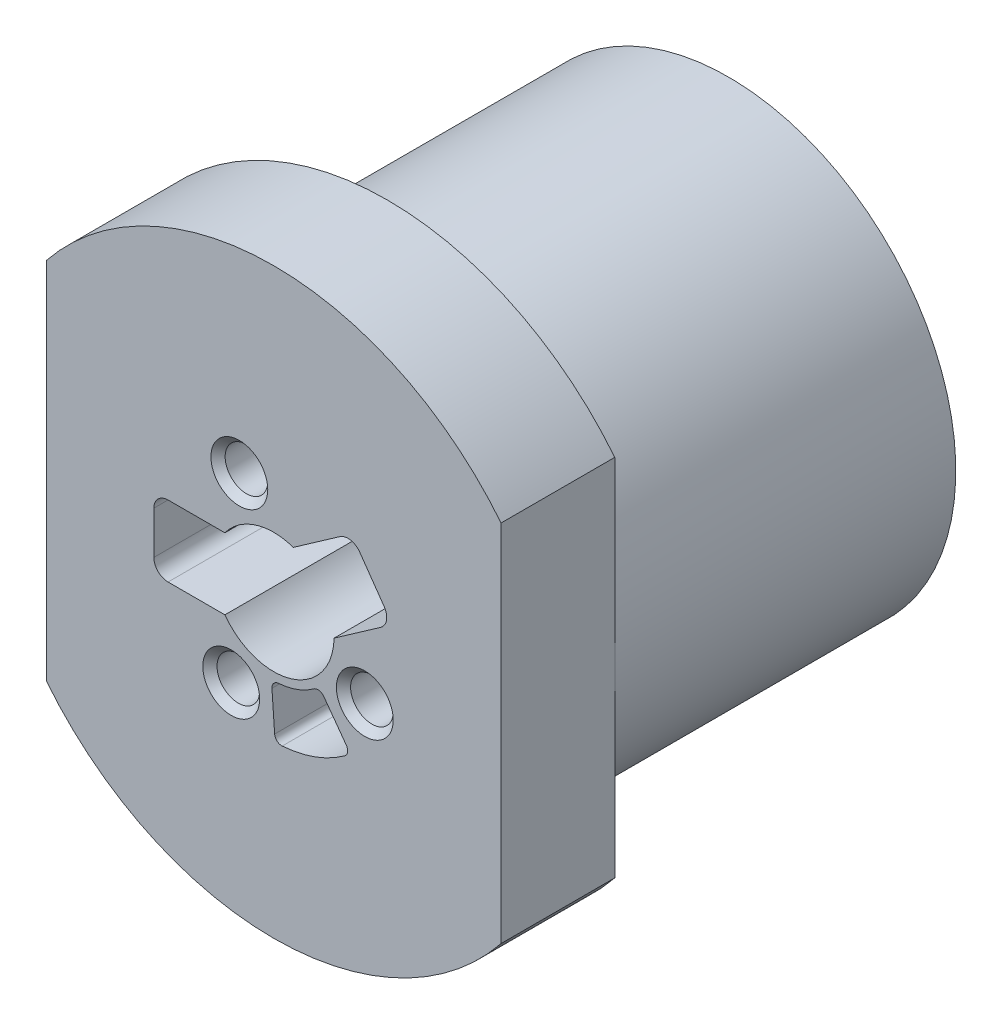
ISO-10303-21;
HEADER;
FILE_DESCRIPTION(('STEP AP214'),'2;1');
FILE_NAME('part.step','',(''),(''),'','','');
FILE_SCHEMA(('AUTOMOTIVE_DESIGN { 1 0 10303 214 1 1 1 1 }'));
ENDSEC;
DATA;
#1=APPLICATION_CONTEXT('core data for automotive mechanical design processes');
#2=APPLICATION_PROTOCOL_DEFINITION('international standard','automotive_design',2000,#1);
#3=PRODUCT_CONTEXT('',#1,'mechanical');
#4=PRODUCT('Part','Part','',(#3));
#5=PRODUCT_RELATED_PRODUCT_CATEGORY('part','',(#4));
#6=PRODUCT_DEFINITION_FORMATION('','',#4);
#7=PRODUCT_DEFINITION_CONTEXT('part definition',#1,'design');
#8=PRODUCT_DEFINITION('design','',#6,#7);
#9=PRODUCT_DEFINITION_SHAPE('','',#8);
#10=(LENGTH_UNIT() NAMED_UNIT(*) SI_UNIT(.MILLI.,.METRE.));
#11=(NAMED_UNIT(*) PLANE_ANGLE_UNIT() SI_UNIT($,.RADIAN.));
#12=(NAMED_UNIT(*) SI_UNIT($,.STERADIAN.) SOLID_ANGLE_UNIT());
#13=UNCERTAINTY_MEASURE_WITH_UNIT(LENGTH_MEASURE(1.E-05),#10,'distance_accuracy_value','');
#14=(GEOMETRIC_REPRESENTATION_CONTEXT(3) GLOBAL_UNCERTAINTY_ASSIGNED_CONTEXT((#13)) GLOBAL_UNIT_ASSIGNED_CONTEXT((#10,
#11,#12)) REPRESENTATION_CONTEXT('',''));
#15=CARTESIAN_POINT('',(0.,0.,0.));
#16=DIRECTION('',(0.,0.,1.));
#17=DIRECTION('',(1.,0.,0.));
#18=AXIS2_PLACEMENT_3D('',#15,#16,#17);
#19=CARTESIAN_POINT('',(0.,0.,0.));
#20=DIRECTION('',(0.,0.,1.00000000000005));
#21=DIRECTION('',(1.00000000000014,0.,0.));
#22=AXIS2_PLACEMENT_3D('',#19,#20,#21);
#23=PLANE('',#22);
#24=CARTESIAN_POINT('',(0.,0.,0.));
#25=DIRECTION('',(0.,0.,-1.00000000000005));
#26=DIRECTION('',(-1.00000000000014,0.,0.));
#27=AXIS2_PLACEMENT_3D('',#24,#25,#26);
#28=CIRCLE('',#27,4.);
#29=CARTESIAN_POINT('',(-4.00000000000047,-1.25163768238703E-13,0.));
#30=VERTEX_POINT('',#29);
#31=EDGE_CURVE('E493',#30,#30,#28,.T.);
#32=ORIENTED_EDGE('',*,*,#31,.F.);
#33=EDGE_LOOP('',(#32));
#34=FACE_BOUND('',#33,.T.);
#35=DIRECTION('',(-0.0701859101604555,0.997533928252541,0.));
#36=VECTOR('',#35,1.);
#37=CARTESIAN_POINT('',(0.371985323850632,-5.28692981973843,-1.23512311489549E-12));
#38=LINE('',#37,#36);
#39=CARTESIAN_POINT('',(0.56148728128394,-7.9802714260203,0.));
#40=VERTEX_POINT('',#39);
#41=CARTESIAN_POINT('',(0.371985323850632,-5.28692981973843,-1.23512311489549E-12));
#42=VERTEX_POINT('',#41);
#43=EDGE_CURVE('E481',#40,#42,#38,.T.);
#44=ORIENTED_EDGE('',*,*,#43,.F.);
#45=CARTESIAN_POINT('',(0.,0.,0.));
#46=DIRECTION('',(0.,0.,-1.00000000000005));
#47=DIRECTION('',(-1.00000000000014,0.,0.));
#48=AXIS2_PLACEMENT_3D('',#45,#46,#47);
#49=CIRCLE('',#48,8.);
#50=CARTESIAN_POINT('',(4.70506778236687,-6.47011106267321,0.));
#51=VERTEX_POINT('',#50);
#52=EDGE_CURVE('E478',#51,#40,#49,.T.);
#53=ORIENTED_EDGE('',*,*,#52,.F.);
#54=DIRECTION('',(0.588133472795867,-0.80876388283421,0.));
#55=VECTOR('',#54,1.);
#56=CARTESIAN_POINT('',(4.70506778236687,-6.47011106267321,0.));
#57=LINE('',#56,#55);
#58=CARTESIAN_POINT('',(3.11710740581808,-4.28644857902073,0.));
#59=VERTEX_POINT('',#58);
#60=EDGE_CURVE('E487',#59,#51,#57,.T.);
#61=ORIENTED_EDGE('',*,*,#60,.F.);
#62=CARTESIAN_POINT('',(0.,0.,0.));
#63=DIRECTION('',(0.,0.,1.00000000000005));
#64=DIRECTION('',(-1.00000000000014,0.,0.));
#65=AXIS2_PLACEMENT_3D('',#62,#63,#64);
#66=CIRCLE('',#65,5.3);
#67=EDGE_CURVE('E484',#42,#59,#66,.T.);
#68=ORIENTED_EDGE('',*,*,#67,.F.);
#69=EDGE_LOOP('',(#44,#53,#61,#68));
#70=FACE_BOUND('',#69,.T.);
#71=CARTESIAN_POINT('',(-2.99000000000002,-6.41,0.));
#72=DIRECTION('',(0.,0.,-1.00000000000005));
#73=DIRECTION('',(-1.00000000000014,0.,0.));
#74=AXIS2_PLACEMENT_3D('',#71,#72,#73);
#75=CIRCLE('',#74,1.5);
#76=CARTESIAN_POINT('',(-4.49000000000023,-6.41000000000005,0.));
#77=VERTEX_POINT('',#76);
#78=EDGE_CURVE('E308',#77,#77,#75,.T.);
#79=ORIENTED_EDGE('',*,*,#78,.F.);
#80=EDGE_LOOP('',(#79));
#81=FACE_BOUND('',#80,.T.);
#82=CARTESIAN_POINT('',(-2.42000000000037,6.63999999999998,0.));
#83=DIRECTION('',(0.,0.,-1.00000000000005));
#84=DIRECTION('',(-1.00000000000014,0.,0.));
#85=AXIS2_PLACEMENT_3D('',#82,#83,#84);
#86=CIRCLE('',#85,1.5);
#87=CARTESIAN_POINT('',(-3.92000000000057,6.63999999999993,0.));
#88=VERTEX_POINT('',#87);
#89=EDGE_CURVE('E305',#88,#88,#86,.T.);
#90=ORIENTED_EDGE('',*,*,#89,.F.);
#91=EDGE_LOOP('',(#90));
#92=FACE_BOUND('',#91,.T.);
#93=CARTESIAN_POINT('',(6.41000000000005,-2.98999999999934,0.));
#94=DIRECTION('',(0.,0.,-1.00000000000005));
#95=DIRECTION('',(-1.00000000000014,0.,0.));
#96=AXIS2_PLACEMENT_3D('',#93,#94,#95);
#97=CIRCLE('',#96,1.5);
#98=CARTESIAN_POINT('',(4.90999999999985,-2.98999999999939,0.));
#99=VERTEX_POINT('',#98);
#100=EDGE_CURVE('E302',#99,#99,#97,.T.);
#101=ORIENTED_EDGE('',*,*,#100,.F.);
#102=EDGE_LOOP('',(#101));
#103=FACE_BOUND('',#102,.T.);
#104=DIRECTION('',(-0.291959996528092,-0.956430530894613,0.));
#105=VECTOR('',#104,1.);
#106=CARTESIAN_POINT('',(-5.91098009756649,-2.75841087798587,0.));
#107=LINE('',#106,#105);
#108=CARTESIAN_POINT('',(-5.91098009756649,-2.75841087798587,0.));
#109=VERTEX_POINT('',#108);
#110=CARTESIAN_POINT('',(-9.08862020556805,-13.1680288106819,-1.23512311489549E-12));
#111=VERTEX_POINT('',#110);
#112=EDGE_CURVE('E51',#109,#111,#107,.T.);
#113=ORIENTED_EDGE('',*,*,#112,.F.);
#114=DIRECTION('',(0.956430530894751,-0.29195999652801,0.));
#115=VECTOR('',#114,1.);
#116=CARTESIAN_POINT('',(-5.91098009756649,-2.75841087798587,0.));
#117=LINE('',#116,#115);
#118=CARTESIAN_POINT('',(-9.5746691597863,-1.64003310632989,0.));
#119=VERTEX_POINT('',#118);
#120=EDGE_CURVE('E68',#119,#109,#117,.T.);
#121=ORIENTED_EDGE('',*,*,#120,.F.);
#122=CARTESIAN_POINT('',(-9.42868916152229,-1.16181784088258,0.));
#123=DIRECTION('',(0.,0.,1.00000000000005));
#124=DIRECTION('',(-1.00000000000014,0.,0.));
#125=AXIS2_PLACEMENT_3D('',#122,#123,#124);
#126=CIRCLE('',#125,0.5);
#127=CARTESIAN_POINT('',(-9.76341439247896,-0.790389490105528,-1.23512311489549E-12));
#128=VERTEX_POINT('',#127);
#129=EDGE_CURVE('E276',#128,#119,#126,.T.);
#130=ORIENTED_EDGE('',*,*,#129,.F.);
#131=DIRECTION('',(-0.742856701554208,-0.66945046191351,0.));
#132=VECTOR('',#131,1.);
#133=CARTESIAN_POINT('',(-9.76341439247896,-0.790389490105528,-1.23512311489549E-12));
#134=LINE('',#133,#132);
#135=CARTESIAN_POINT('',(-7.10254297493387,1.60754485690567,2.28983498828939E-13));
#136=VERTEX_POINT('',#135);
#137=EDGE_CURVE('E272',#136,#128,#134,.T.);
#138=ORIENTED_EDGE('',*,*,#137,.F.);
#139=DIRECTION('',(0.669450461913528,-0.742856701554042,0.));
#140=VECTOR('',#139,1.);
#141=CARTESIAN_POINT('',(-7.10254297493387,1.60754485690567,2.28983498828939E-13));
#142=LINE('',#141,#140);
#143=CARTESIAN_POINT('',(-13.4555848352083,8.6572072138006,0.));
#144=VERTEX_POINT('',#143);
#145=EDGE_CURVE('E274',#144,#136,#142,.T.);
#146=ORIENTED_EDGE('',*,*,#145,.F.);
#147=CARTESIAN_POINT('',(0.,0.,0.));
#148=DIRECTION('',(0.,0.,1.00000000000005));
#149=DIRECTION('',(1.00000000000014,0.,0.));
#150=AXIS2_PLACEMENT_3D('',#147,#148,#149);
#151=CIRCLE('',#150,16.);
#152=EDGE_CURVE('E532',#111,#144,#151,.T.);
#153=ORIENTED_EDGE('',*,*,#152,.F.);
#154=EDGE_LOOP('',(#113,#121,#130,#138,#146,#153));
#155=FACE_BOUND('',#154,.T.);
#156=ADVANCED_FACE('F47',(#34,#70,#81,#92,#103,#155),#23,.F.);
#157=CARTESIAN_POINT('',(-6.93889390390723E-13,0.,32.0009999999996));
#158=DIRECTION('',(0.,0.,-1.00000000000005));
#159=DIRECTION('',(-1.00000000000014,0.,0.));
#160=AXIS2_PLACEMENT_3D('',#157,#158,#159);
#161=CYLINDRICAL_SURFACE('',#160,8.);
#162=CARTESIAN_POINT('',(-5.71764857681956E-12,0.,12.));
#163=DIRECTION('',(0.,0.,1.00000000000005));
#164=DIRECTION('',(1.00000000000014,0.,0.));
#165=AXIS2_PLACEMENT_3D('',#162,#163,#164);
#166=CIRCLE('',#165,8.);
#167=CARTESIAN_POINT('',(4.70506778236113,-6.4701110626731,12.0000000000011));
#168=VERTEX_POINT('',#167);
#169=CARTESIAN_POINT('',(0.561487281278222,-7.98027142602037,12.));
#170=VERTEX_POINT('',#169);
#171=EDGE_CURVE('E379',#168,#170,#166,.F.);
#172=ORIENTED_EDGE('',*,*,#171,.F.);
#173=DIRECTION('',(0.,0.,-1.00000000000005));
#174=VECTOR('',#173,1.);
#175=CARTESIAN_POINT('',(4.70506778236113,-6.47011106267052,32.001));
#176=LINE('',#175,#174);
#177=EDGE_CURVE('E491',#168,#51,#176,.T.);
#178=ORIENTED_EDGE('',*,*,#177,.T.);
#179=ORIENTED_EDGE('',*,*,#52,.T.);
#180=DIRECTION('',(0.,0.,-1.00000000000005));
#181=VECTOR('',#180,1.);
#182=CARTESIAN_POINT('',(0.561487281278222,-7.98027142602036,32.0010000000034));
#183=LINE('',#182,#181);
#184=EDGE_CURVE('E490',#170,#40,#183,.T.);
#185=ORIENTED_EDGE('',*,*,#184,.F.);
#186=EDGE_LOOP('',(#172,#178,#179,#185));
#187=FACE_BOUND('',#186,.T.);
#188=ADVANCED_FACE('F605',(#187),#161,.F.);
#189=CARTESIAN_POINT('',(4.70506778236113,-6.47011106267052,32.001));
#190=DIRECTION('',(0.808763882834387,0.588133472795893,0.));
#191=DIRECTION('',(-0.588133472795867,0.80876388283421,0.));
#192=AXIS2_PLACEMENT_3D('',#189,#190,#191);
#193=PLANE('',#192);
#194=DIRECTION('',(0.588133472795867,-0.80876388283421,0.));
#195=VECTOR('',#194,1.);
#196=CARTESIAN_POINT('',(4.70506778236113,-6.4701110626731,12.0000000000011));
#197=LINE('',#196,#195);
#198=CARTESIAN_POINT('',(3.11710740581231,-4.28644857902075,12.));
#199=VERTEX_POINT('',#198);
#200=EDGE_CURVE('E377',#199,#168,#197,.T.);
#201=ORIENTED_EDGE('',*,*,#200,.F.);
#202=DIRECTION('',(0.,0.,-1.00000000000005));
#203=VECTOR('',#202,1.);
#204=CARTESIAN_POINT('',(3.1171074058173,-4.28644857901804,32.0010000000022));
#205=LINE('',#204,#203);
#206=EDGE_CURVE('E494',#199,#59,#205,.T.);
#207=ORIENTED_EDGE('',*,*,#206,.T.);
#208=ORIENTED_EDGE('',*,*,#60,.T.);
#209=ORIENTED_EDGE('',*,*,#177,.F.);
#210=EDGE_LOOP('',(#201,#207,#208,#209));
#211=FACE_BOUND('',#210,.T.);
#212=ADVANCED_FACE('F610',(#211),#193,.F.);
#213=CARTESIAN_POINT('',(-6.93889390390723E-13,0.,32.0009999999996));
#214=DIRECTION('',(0.,0.,-1.00000000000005));
#215=DIRECTION('',(-1.00000000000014,0.,0.));
#216=AXIS2_PLACEMENT_3D('',#213,#214,#215);
#217=CYLINDRICAL_SURFACE('',#216,5.3);
#218=CARTESIAN_POINT('',(-5.71764857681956E-12,0.,12.));
#219=DIRECTION('',(0.,0.,1.00000000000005));
#220=DIRECTION('',(1.00000000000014,0.,0.));
#221=AXIS2_PLACEMENT_3D('',#218,#219,#220);
#222=CIRCLE('',#221,5.3);
#223=CARTESIAN_POINT('',(0.371985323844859,-5.28692981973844,12.0000000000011));
#224=VERTEX_POINT('',#223);
#225=EDGE_CURVE('E361',#224,#199,#222,.T.);
#226=ORIENTED_EDGE('',*,*,#225,.F.);
#227=DIRECTION('',(0.,0.,-1.00000000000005));
#228=VECTOR('',#227,1.);
#229=CARTESIAN_POINT('',(0.371985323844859,-5.28692981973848,32.001));
#230=LINE('',#229,#228);
#231=EDGE_CURVE('E496',#224,#42,#230,.T.);
#232=ORIENTED_EDGE('',*,*,#231,.T.);
#233=ORIENTED_EDGE('',*,*,#67,.T.);
#234=ORIENTED_EDGE('',*,*,#206,.F.);
#235=EDGE_LOOP('',(#226,#232,#233,#234));
#236=FACE_BOUND('',#235,.T.);
#237=ADVANCED_FACE('F646',(#236),#217,.T.);
#238=CARTESIAN_POINT('',(0.371985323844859,-5.28692981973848,32.001));
#239=DIRECTION('',(-0.997533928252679,-0.0701859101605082,0.));
#240=DIRECTION('',(0.0701859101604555,-0.997533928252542,0.));
#241=AXIS2_PLACEMENT_3D('',#238,#239,#240);
#242=PLANE('',#241);
#243=DIRECTION('',(-0.0701859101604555,0.997533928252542,0.));
#244=VECTOR('',#243,1.);
#245=CARTESIAN_POINT('',(0.371985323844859,-5.28692981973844,12.0000000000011));
#246=LINE('',#245,#244);
#247=EDGE_CURVE('E536',#170,#224,#246,.T.);
#248=ORIENTED_EDGE('',*,*,#247,.F.);
#249=ORIENTED_EDGE('',*,*,#184,.T.);
#250=ORIENTED_EDGE('',*,*,#43,.T.);
#251=ORIENTED_EDGE('',*,*,#231,.F.);
#252=EDGE_LOOP('',(#248,#249,#250,#251));
#253=FACE_BOUND('',#252,.T.);
#254=ADVANCED_FACE('F641',(#253),#242,.F.);
#255=CARTESIAN_POINT('',(-6.93889390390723E-13,0.,32.0009999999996));
#256=DIRECTION('',(0.,0.,-1.00000000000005));
#257=DIRECTION('',(-1.00000000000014,0.,0.));
#258=AXIS2_PLACEMENT_3D('',#255,#256,#257);
#259=CYLINDRICAL_SURFACE('',#258,4.);
#260=ORIENTED_EDGE('',*,*,#31,.T.);
#261=EDGE_LOOP('',(#260));
#262=FACE_BOUND('',#261,.T.);
#263=CARTESIAN_POINT('',(-5.71764857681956E-12,0.,12.));
#264=DIRECTION('',(0.,0.,1.00000000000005));
#265=DIRECTION('',(1.00000000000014,0.,0.));
#266=AXIS2_PLACEMENT_3D('',#263,#264,#265);
#267=CIRCLE('',#266,4.);
#268=CARTESIAN_POINT('',(3.99999999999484,1.52919343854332E-13,12.));
#269=VERTEX_POINT('',#268);
#270=EDGE_CURVE('E455',#269,#269,#267,.F.);
#271=ORIENTED_EDGE('',*,*,#270,.F.);
#272=EDGE_LOOP('',(#271));
#273=FACE_BOUND('',#272,.T.);
#274=ADVANCED_FACE('F639',(#262,#273),#259,.F.);
#275=CARTESIAN_POINT('',(-4.46864767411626E-12,0.,24.0000000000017));
#276=DIRECTION('',(0.,0.,1.00000000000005));
#277=DIRECTION('',(1.00000000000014,0.,0.));
#278=AXIS2_PLACEMENT_3D('',#275,#276,#277);
#279=PLANE('',#278);
#280=CARTESIAN_POINT('',(-4.46864767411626E-12,0.,24.0000000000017));
#281=DIRECTION('',(0.,0.,1.00000000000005));
#282=DIRECTION('',(1.00000000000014,0.,0.));
#283=AXIS2_PLACEMENT_3D('',#280,#281,#282);
#284=CIRCLE('',#283,20.5);
#285=CARTESIAN_POINT('',(-16.0000000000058,-12.8160056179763,24.0000000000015));
#286=VERTEX_POINT('',#285);
#287=CARTESIAN_POINT('',(15.9999999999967,-12.8160056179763,24.0000000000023));
#288=VERTEX_POINT('',#287);
#289=EDGE_CURVE('E523',#286,#288,#284,.T.);
#290=ORIENTED_EDGE('',*,*,#289,.F.);
#291=DIRECTION('',(0.,1.,0.));
#292=VECTOR('',#291,1.);
#293=CARTESIAN_POINT('',(-16.0000000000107,12.8160056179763,24.0000000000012));
#294=LINE('',#293,#292);
#295=CARTESIAN_POINT('',(-16.0000000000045,0.,24.0000000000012));
#296=VERTEX_POINT('',#295);
#297=EDGE_CURVE('E504',#286,#296,#294,.T.);
#298=ORIENTED_EDGE('',*,*,#297,.T.);
#299=CARTESIAN_POINT('',(-4.46864767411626E-12,0.,24.0000000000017));
#300=DIRECTION('',(0.,0.,1.00000000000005));
#301=DIRECTION('',(1.00000000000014,0.,0.));
#302=AXIS2_PLACEMENT_3D('',#299,#300,#301);
#303=CIRCLE('',#302,16.);
#304=CARTESIAN_POINT('',(16.0000000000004,0.,24.0000000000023));
#305=VERTEX_POINT('',#304);
#306=EDGE_CURVE('E537',#296,#305,#303,.T.);
#307=ORIENTED_EDGE('',*,*,#306,.T.);
#308=DIRECTION('',(0.,-1.,0.));
#309=VECTOR('',#308,1.);
#310=CARTESIAN_POINT('',(15.9999999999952,12.8160056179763,24.0000000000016));
#311=LINE('',#310,#309);
#312=EDGE_CURVE('E515',#305,#288,#311,.T.);
#313=ORIENTED_EDGE('',*,*,#312,.T.);
#314=EDGE_LOOP('',(#290,#298,#307,#313));
#315=FACE_BOUND('',#314,.T.);
#316=ADVANCED_FACE('F630',(#315),#279,.F.);
#317=CARTESIAN_POINT('',(-6.93889390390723E-13,0.,31.9999999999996));
#318=DIRECTION('',(0.,0.,-1.00000000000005));
#319=DIRECTION('',(-1.00000000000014,0.,0.));
#320=AXIS2_PLACEMENT_3D('',#317,#318,#319);
#321=CYLINDRICAL_SURFACE('',#320,20.5);
#322=CARTESIAN_POINT('',(-6.93889390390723E-13,0.,31.9999999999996));
#323=DIRECTION('',(0.,0.,1.00000000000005));
#324=DIRECTION('',(1.00000000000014,0.,0.));
#325=AXIS2_PLACEMENT_3D('',#322,#323,#324);
#326=CIRCLE('',#325,20.5);
#327=CARTESIAN_POINT('',(-16.0000000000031,-12.8160056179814,32.0000000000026));
#328=VERTEX_POINT('',#327);
#329=CARTESIAN_POINT('',(15.9999999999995,-12.8160056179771,31.9999999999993));
#330=VERTEX_POINT('',#329);
#331=EDGE_CURVE('E528',#328,#330,#326,.T.);
#332=ORIENTED_EDGE('',*,*,#331,.F.);
#333=DIRECTION('',(0.,0.,1.00000000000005));
#334=VECTOR('',#333,1.);
#335=CARTESIAN_POINT('',(-16.0000000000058,-12.8160056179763,24.0000000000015));
#336=LINE('',#335,#334);
#337=EDGE_CURVE('E507',#286,#328,#336,.T.);
#338=ORIENTED_EDGE('',*,*,#337,.F.);
#339=ORIENTED_EDGE('',*,*,#289,.T.);
#340=DIRECTION('',(0.,0.,1.00000000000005));
#341=VECTOR('',#340,1.);
#342=CARTESIAN_POINT('',(15.9999999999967,-12.8160056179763,24.0000000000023));
#343=LINE('',#342,#341);
#344=EDGE_CURVE('E520',#288,#330,#343,.T.);
#345=ORIENTED_EDGE('',*,*,#344,.T.);
#346=EDGE_LOOP('',(#332,#338,#339,#345));
#347=FACE_BOUND('',#346,.T.);
#348=ADVANCED_FACE('F622',(#347),#321,.T.);
#349=CARTESIAN_POINT('',(-4.46864767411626E-12,0.,24.0000000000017));
#350=DIRECTION('',(0.,0.,-1.00000000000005));
#351=DIRECTION('',(-1.00000000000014,0.,0.));
#352=AXIS2_PLACEMENT_3D('',#349,#350,#351);
#353=CYLINDRICAL_SURFACE('',#352,16.);
#354=EDGE_CURVE('E533',#305,#296,#303,.T.);
#355=ORIENTED_EDGE('',*,*,#354,.F.);
#356=ORIENTED_EDGE('',*,*,#306,.F.);
#357=EDGE_LOOP('',(#355,#356));
#358=FACE_BOUND('',#357,.T.);
#359=ORIENTED_EDGE('',*,*,#152,.T.);
#360=DIRECTION('',(0.,0.,1.00000000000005));
#361=VECTOR('',#360,1.);
#362=CARTESIAN_POINT('',(-13.4555848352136,8.65720721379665,-4.36000000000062));
#363=LINE('',#362,#361);
#364=CARTESIAN_POINT('',(-13.4555848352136,8.65720721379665,-4.36000000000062));
#365=VERTEX_POINT('',#364);
#366=EDGE_CURVE('E290',#365,#144,#363,.T.);
#367=ORIENTED_EDGE('',*,*,#366,.F.);
#368=CARTESIAN_POINT('',(-5.49560397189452E-12,-4.91273688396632E-12,-4.36));
#369=DIRECTION('',(0.,0.,-1.00000000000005));
#370=DIRECTION('',(-1.00000000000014,0.,0.));
#371=AXIS2_PLACEMENT_3D('',#368,#369,#370);
#372=CIRCLE('',#371,16.);
#373=CARTESIAN_POINT('',(-9.08862020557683,-13.1680288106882,-4.35999999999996));
#374=VERTEX_POINT('',#373);
#375=EDGE_CURVE('E566',#374,#365,#372,.T.);
#376=ORIENTED_EDGE('',*,*,#375,.F.);
#377=DIRECTION('',(0.,0.,1.00000000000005));
#378=VECTOR('',#377,1.);
#379=CARTESIAN_POINT('',(-9.08862020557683,-13.1680288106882,-4.35999999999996));
#380=LINE('',#379,#378);
#381=EDGE_CURVE('E296',#374,#111,#380,.T.);
#382=ORIENTED_EDGE('',*,*,#381,.T.);
#383=EDGE_LOOP('',(#359,#367,#376,#382));
#384=FACE_BOUND('',#383,.T.);
#385=ADVANCED_FACE('F49',(#358,#384),#353,.T.);
#386=ORIENTED_EDGE('',*,*,#354,.T.);
#387=CARTESIAN_POINT('',(-16.0000000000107,12.8160056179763,24.0000000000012));
#388=VERTEX_POINT('',#387);
#389=EDGE_CURVE('E503',#296,#388,#294,.T.);
#390=ORIENTED_EDGE('',*,*,#389,.T.);
#391=CARTESIAN_POINT('',(15.9999999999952,12.8160056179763,24.0000000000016));
#392=VERTEX_POINT('',#391);
#393=EDGE_CURVE('E525',#392,#388,#284,.T.);
#394=ORIENTED_EDGE('',*,*,#393,.F.);
#395=EDGE_CURVE('E516',#392,#305,#311,.T.);
#396=ORIENTED_EDGE('',*,*,#395,.T.);
#397=EDGE_LOOP('',(#386,#390,#394,#396));
#398=FACE_BOUND('',#397,.T.);
#399=ADVANCED_FACE('F620',(#398),#279,.F.);
#400=ORIENTED_EDGE('',*,*,#393,.T.);
#401=DIRECTION('',(0.,0.,1.00000000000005));
#402=VECTOR('',#401,1.);
#403=CARTESIAN_POINT('',(-16.0000000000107,12.8160056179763,24.0000000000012));
#404=LINE('',#403,#402);
#405=CARTESIAN_POINT('',(-16.0000000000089,12.8160056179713,32.0000000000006));
#406=VERTEX_POINT('',#405);
#407=EDGE_CURVE('E508',#388,#406,#404,.T.);
#408=ORIENTED_EDGE('',*,*,#407,.T.);
#409=CARTESIAN_POINT('',(15.9999999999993,12.8160056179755,32.0000000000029));
#410=VERTEX_POINT('',#409);
#411=EDGE_CURVE('E529',#410,#406,#326,.T.);
#412=ORIENTED_EDGE('',*,*,#411,.F.);
#413=DIRECTION('',(0.,0.,1.00000000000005));
#414=VECTOR('',#413,1.);
#415=CARTESIAN_POINT('',(15.9999999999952,12.8160056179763,24.0000000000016));
#416=LINE('',#415,#414);
#417=EDGE_CURVE('E519',#392,#410,#416,.T.);
#418=ORIENTED_EDGE('',*,*,#417,.F.);
#419=EDGE_LOOP('',(#400,#408,#412,#418));
#420=FACE_BOUND('',#419,.T.);
#421=ADVANCED_FACE('F616',(#420),#321,.T.);
#422=CARTESIAN_POINT('',(-6.93889390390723E-13,0.,31.9999999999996));
#423=DIRECTION('',(0.,0.,1.00000000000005));
#424=DIRECTION('',(1.00000000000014,0.,0.));
#425=AXIS2_PLACEMENT_3D('',#422,#423,#424);
#426=PLANE('',#425);
#427=CARTESIAN_POINT('',(-2.41999999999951,6.6399999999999,32.0000000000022));
#428=DIRECTION('',(0.,0.,1.00000000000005));
#429=DIRECTION('',(1.00000000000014,0.,0.));
#430=AXIS2_PLACEMENT_3D('',#427,#428,#429);
#431=CIRCLE('',#430,2.);
#432=CARTESIAN_POINT('',(-0.419999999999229,6.63999999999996,32.0000000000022));
#433=VERTEX_POINT('',#432);
#434=EDGE_CURVE('E547',#433,#433,#431,.F.);
#435=ORIENTED_EDGE('',*,*,#434,.T.);
#436=EDGE_LOOP('',(#435));
#437=FACE_BOUND('',#436,.T.);
#438=CARTESIAN_POINT('',(6.40999999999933,-2.98999999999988,32.0000000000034));
#439=DIRECTION('',(0.,0.,1.00000000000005));
#440=DIRECTION('',(1.00000000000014,0.,0.));
#441=AXIS2_PLACEMENT_3D('',#438,#439,#440);
#442=CIRCLE('',#441,2.);
#443=CARTESIAN_POINT('',(8.40999999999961,-2.98999999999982,32.0000000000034));
#444=VERTEX_POINT('',#443);
#445=EDGE_CURVE('E544',#444,#444,#442,.F.);
#446=ORIENTED_EDGE('',*,*,#445,.T.);
#447=EDGE_LOOP('',(#446));
#448=FACE_BOUND('',#447,.T.);
#449=CARTESIAN_POINT('',(-2.99000000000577,-6.41000000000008,32.0000000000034));
#450=DIRECTION('',(0.,0.,1.00000000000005));
#451=DIRECTION('',(1.00000000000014,0.,0.));
#452=AXIS2_PLACEMENT_3D('',#449,#450,#451);
#453=CIRCLE('',#452,2.);
#454=CARTESIAN_POINT('',(-0.990000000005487,-6.41000000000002,32.0000000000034));
#455=VERTEX_POINT('',#454);
#456=EDGE_CURVE('E541',#455,#455,#453,.F.);
#457=ORIENTED_EDGE('',*,*,#456,.T.);
#458=EDGE_LOOP('',(#457));
#459=FACE_BOUND('',#458,.T.);
#460=CARTESIAN_POINT('',(3.1171074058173,-4.28644857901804,32.0000000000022));
#461=DIRECTION('',(0.,0.,1.00000000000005));
#462=DIRECTION('',(1.00000000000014,0.,0.));
#463=AXIS2_PLACEMENT_3D('',#460,#461,#462);
#464=CIRCLE('',#463,0.499999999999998);
#465=CARTESIAN_POINT('',(3.52148934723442,-3.99238184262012,31.9999999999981));
#466=VERTEX_POINT('',#465);
#467=CARTESIAN_POINT('',(2.82304066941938,-3.88206663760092,31.9999999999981));
#468=VERTEX_POINT('',#467);
#469=EDGE_CURVE('E311',#466,#468,#464,.T.);
#470=ORIENTED_EDGE('',*,*,#469,.F.);
#471=DIRECTION('',(-0.588133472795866,0.808763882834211,0.));
#472=VECTOR('',#471,1.);
#473=CARTESIAN_POINT('',(5.10944972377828,-6.1760443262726,32.0000000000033));
#474=LINE('',#473,#472);
#475=CARTESIAN_POINT('',(5.10944972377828,-6.1760443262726,32.0000000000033));
#476=VERTEX_POINT('',#475);
#477=EDGE_CURVE('E331',#476,#466,#474,.T.);
#478=ORIENTED_EDGE('',*,*,#477,.F.);
#479=CARTESIAN_POINT('',(4.70506778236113,-6.47011106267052,32.));
#480=DIRECTION('',(0.,0.,1.00000000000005));
#481=DIRECTION('',(1.00000000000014,0.,0.));
#482=AXIS2_PLACEMENT_3D('',#479,#480,#481);
#483=CIRCLE('',#482,0.5);
#484=CARTESIAN_POINT('',(4.99913451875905,-6.87449300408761,31.9999999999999));
#485=VERTEX_POINT('',#484);
#486=EDGE_CURVE('E328',#485,#476,#483,.T.);
#487=ORIENTED_EDGE('',*,*,#486,.F.);
#488=CARTESIAN_POINT('',(-6.93889390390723E-13,0.,31.9999999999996));
#489=DIRECTION('',(0.,0.,1.00000000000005));
#490=DIRECTION('',(1.00000000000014,0.,0.));
#491=AXIS2_PLACEMENT_3D('',#488,#489,#490);
#492=CIRCLE('',#491,8.5);
#493=CARTESIAN_POINT('',(0.596580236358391,-8.47903839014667,32.0000000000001));
#494=VERTEX_POINT('',#493);
#495=EDGE_CURVE('E325',#494,#485,#492,.T.);
#496=ORIENTED_EDGE('',*,*,#495,.F.);
#497=CARTESIAN_POINT('',(0.561487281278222,-7.98027142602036,32.0000000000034));
#498=DIRECTION('',(0.,0.,1.00000000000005));
#499=DIRECTION('',(1.00000000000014,0.,0.));
#500=AXIS2_PLACEMENT_3D('',#497,#498,#499);
#501=CIRCLE('',#500,0.5);
#502=CARTESIAN_POINT('',(0.0627203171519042,-8.01536438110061,32.0000000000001));
#503=VERTEX_POINT('',#502);
#504=EDGE_CURVE('E322',#503,#494,#501,.T.);
#505=ORIENTED_EDGE('',*,*,#504,.F.);
#506=DIRECTION('',(0.0701859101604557,-0.997533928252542,0.));
#507=VECTOR('',#506,1.);
#508=CARTESIAN_POINT('',(-0.126781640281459,-5.3220227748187,32.0000000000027));
#509=LINE('',#508,#507);
#510=CARTESIAN_POINT('',(-0.126781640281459,-5.3220227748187,32.0000000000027));
#511=VERTEX_POINT('',#510);
#512=EDGE_CURVE('E319',#511,#503,#509,.T.);
#513=ORIENTED_EDGE('',*,*,#512,.F.);
#514=CARTESIAN_POINT('',(0.371985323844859,-5.28692981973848,32.));
#515=DIRECTION('',(0.,0.,1.00000000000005));
#516=DIRECTION('',(1.00000000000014,0.,0.));
#517=AXIS2_PLACEMENT_3D('',#514,#515,#516);
#518=CIRCLE('',#517,0.5);
#519=CARTESIAN_POINT('',(0.336892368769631,-4.78816285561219,32.));
#520=VERTEX_POINT('',#519);
#521=EDGE_CURVE('E316',#520,#511,#518,.T.);
#522=ORIENTED_EDGE('',*,*,#521,.F.);
#523=CARTESIAN_POINT('',(-6.93889390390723E-13,0.,31.9999999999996));
#524=DIRECTION('',(0.,0.,-1.00000000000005));
#525=DIRECTION('',(1.00000000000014,0.,0.));
#526=AXIS2_PLACEMENT_3D('',#523,#524,#525);
#527=CIRCLE('',#526,4.8);
#528=EDGE_CURVE('E313',#468,#520,#527,.T.);
#529=ORIENTED_EDGE('',*,*,#528,.F.);
#530=EDGE_LOOP('',(#470,#478,#487,#496,#505,#513,#522,#529));
#531=FACE_BOUND('',#530,.T.);
#532=CARTESIAN_POINT('',(-6.93889390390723E-13,0.,31.9999999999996));
#533=DIRECTION('',(0.,0.,1.00000000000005));
#534=DIRECTION('',(1.00000000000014,0.,0.));
#535=AXIS2_PLACEMENT_3D('',#532,#533,#534);
#536=CIRCLE('',#535,4.25);
#537=CARTESIAN_POINT('',(-3.43693177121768,-2.50000000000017,32.0000000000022));
#538=VERTEX_POINT('',#537);
#539=CARTESIAN_POINT('',(4.24931077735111,-0.0765370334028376,32.));
#540=VERTEX_POINT('',#539);
#541=EDGE_CURVE('E381',#538,#540,#536,.T.);
#542=ORIENTED_EDGE('',*,*,#541,.F.);
#543=DIRECTION('',(1.00000000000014,0.,0.));
#544=VECTOR('',#543,1.);
#545=CARTESIAN_POINT('',(-7.4369317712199,-2.50000000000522,32.));
#546=LINE('',#545,#544);
#547=CARTESIAN_POINT('',(-7.4369317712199,-2.50000000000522,32.));
#548=VERTEX_POINT('',#547);
#549=EDGE_CURVE('E413',#548,#538,#546,.T.);
#550=ORIENTED_EDGE('',*,*,#549,.F.);
#551=CARTESIAN_POINT('',(-7.43693177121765,-1.50000000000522,32.0000000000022));
#552=DIRECTION('',(0.,0.,1.00000000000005));
#553=DIRECTION('',(1.00000000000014,0.,0.));
#554=AXIS2_PLACEMENT_3D('',#551,#552,#553);
#555=CIRCLE('',#554,1.);
#556=CARTESIAN_POINT('',(-8.43693177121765,-1.50000000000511,32.0000000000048));
#557=VERTEX_POINT('',#556);
#558=EDGE_CURVE('E410',#557,#548,#555,.T.);
#559=ORIENTED_EDGE('',*,*,#558,.F.);
#560=DIRECTION('',(0.,-1.,0.));
#561=VECTOR('',#560,1.);
#562=CARTESIAN_POINT('',(-8.43693177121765,-1.50000000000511,32.0000000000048));
#563=LINE('',#562,#561);
#564=CARTESIAN_POINT('',(-8.4369317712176,1.49999999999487,32.0000000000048));
#565=VERTEX_POINT('',#564);
#566=EDGE_CURVE('E407',#565,#557,#563,.T.);
#567=ORIENTED_EDGE('',*,*,#566,.F.);
#568=CARTESIAN_POINT('',(-7.4369317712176,1.49999999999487,32.0000000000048));
#569=DIRECTION('',(0.,0.,1.00000000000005));
#570=DIRECTION('',(-1.00000000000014,0.,0.));
#571=AXIS2_PLACEMENT_3D('',#568,#569,#570);
#572=CIRCLE('',#571,1.);
#573=CARTESIAN_POINT('',(-7.4369317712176,2.49999999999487,31.9999999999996));
#574=VERTEX_POINT('',#573);
#575=EDGE_CURVE('E404',#574,#565,#572,.T.);
#576=ORIENTED_EDGE('',*,*,#575,.F.);
#577=DIRECTION('',(-1.00000000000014,0.,0.));
#578=VECTOR('',#577,1.);
#579=CARTESIAN_POINT('',(-3.43693177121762,2.49999999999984,32.));
#580=LINE('',#579,#578);
#581=CARTESIAN_POINT('',(-3.43693177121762,2.49999999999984,32.));
#582=VERTEX_POINT('',#581);
#583=EDGE_CURVE('E401',#582,#574,#580,.T.);
#584=ORIENTED_EDGE('',*,*,#583,.F.);
#585=CARTESIAN_POINT('',(-6.93889390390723E-13,0.,31.9999999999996));
#586=DIRECTION('',(0.,0.,1.00000000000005));
#587=DIRECTION('',(1.00000000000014,0.,0.));
#588=AXIS2_PLACEMENT_3D('',#585,#586,#587);
#589=CIRCLE('',#588,4.25);
#590=CARTESIAN_POINT('',(1.38142859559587,4.01922318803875,32.));
#591=VERTEX_POINT('',#590);
#592=EDGE_CURVE('E398',#591,#582,#589,.T.);
#593=ORIENTED_EDGE('',*,*,#592,.F.);
#594=DIRECTION('',(-0.819152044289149,-0.573576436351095,0.));
#595=VECTOR('',#594,1.);
#596=CARTESIAN_POINT('',(4.65803677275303,6.31352893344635,32.));
#597=LINE('',#596,#595);
#598=CARTESIAN_POINT('',(4.65803677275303,6.31352893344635,32.));
#599=VERTEX_POINT('',#598);
#600=EDGE_CURVE('E395',#599,#591,#597,.T.);
#601=ORIENTED_EDGE('',*,*,#600,.F.);
#602=CARTESIAN_POINT('',(5.23161320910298,5.49437688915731,31.9999999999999));
#603=DIRECTION('',(0.,0.,1.00000000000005));
#604=DIRECTION('',(1.00000000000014,0.,0.));
#605=AXIS2_PLACEMENT_3D('',#602,#603,#604);
#606=CIRCLE('',#605,0.999999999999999);
#607=CARTESIAN_POINT('',(6.05076525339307,6.06795332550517,32.));
#608=VERTEX_POINT('',#607);
#609=EDGE_CURVE('E392',#608,#599,#606,.T.);
#610=ORIENTED_EDGE('',*,*,#609,.F.);
#611=DIRECTION('',(-0.573576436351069,0.819152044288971,0.));
#612=VECTOR('',#611,1.);
#613=CARTESIAN_POINT('',(6.05076525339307,6.06795332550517,32.));
#614=LINE('',#613,#612);
#615=CARTESIAN_POINT('',(7.771494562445,3.61049719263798,32.0000000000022));
#616=VERTEX_POINT('',#615);
#617=EDGE_CURVE('E389',#616,#608,#614,.T.);
#618=ORIENTED_EDGE('',*,*,#617,.F.);
#619=CARTESIAN_POINT('',(6.95234251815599,3.03692075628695,32.0000000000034));
#620=DIRECTION('',(0.,0.,1.00000000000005));
#621=DIRECTION('',(-1.00000000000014,0.,0.));
#622=AXIS2_PLACEMENT_3D('',#619,#620,#621);
#623=CIRCLE('',#622,1.);
#624=CARTESIAN_POINT('',(7.52591895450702,2.21776871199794,32.0000000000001));
#625=VERTEX_POINT('',#624);
#626=EDGE_CURVE('E386',#625,#616,#623,.T.);
#627=ORIENTED_EDGE('',*,*,#626,.F.);
#628=DIRECTION('',(0.819152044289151,0.573576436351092,0.));
#629=VECTOR('',#628,1.);
#630=CARTESIAN_POINT('',(4.24931077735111,-0.0765370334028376,32.));
#631=LINE('',#630,#629);
#632=EDGE_CURVE('E383',#540,#625,#631,.T.);
#633=ORIENTED_EDGE('',*,*,#632,.F.);
#634=EDGE_LOOP('',(#542,#550,#559,#567,#576,#584,#593,#601,#610,#618,#627,#633));
#635=FACE_BOUND('',#634,.T.);
#636=DIRECTION('',(0.,1.,0.));
#637=VECTOR('',#636,1.);
#638=CARTESIAN_POINT('',(-16.0000000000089,12.8160056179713,32.0000000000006));
#639=LINE('',#638,#637);
#640=EDGE_CURVE('E501',#328,#406,#639,.T.);
#641=ORIENTED_EDGE('',*,*,#640,.F.);
#642=ORIENTED_EDGE('',*,*,#331,.T.);
#643=DIRECTION('',(0.,-1.,0.));
#644=VECTOR('',#643,1.);
#645=CARTESIAN_POINT('',(15.9999999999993,12.8160056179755,32.0000000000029));
#646=LINE('',#645,#644);
#647=EDGE_CURVE('E511',#410,#330,#646,.T.);
#648=ORIENTED_EDGE('',*,*,#647,.F.);
#649=ORIENTED_EDGE('',*,*,#411,.T.);
#650=EDGE_LOOP('',(#641,#642,#648,#649));
#651=FACE_BOUND('',#650,.T.);
#652=ADVANCED_FACE('F619',(#437,#448,#459,#531,#635,#651),#426,.T.);
#653=CARTESIAN_POINT('',(15.9999999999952,12.8160056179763,24.0000000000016));
#654=DIRECTION('',(-1.00000000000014,0.,0.));
#655=DIRECTION('',(0.,-1.,0.));
#656=AXIS2_PLACEMENT_3D('',#653,#654,#655);
#657=PLANE('',#656);
#658=ORIENTED_EDGE('',*,*,#647,.T.);
#659=ORIENTED_EDGE('',*,*,#344,.F.);
#660=ORIENTED_EDGE('',*,*,#312,.F.);
#661=ORIENTED_EDGE('',*,*,#395,.F.);
#662=ORIENTED_EDGE('',*,*,#417,.T.);
#663=EDGE_LOOP('',(#658,#659,#660,#661,#662));
#664=FACE_BOUND('',#663,.T.);
#665=ADVANCED_FACE('F625',(#664),#657,.F.);
#666=CARTESIAN_POINT('',(-16.0000000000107,12.8160056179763,24.0000000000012));
#667=DIRECTION('',(1.00000000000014,0.,0.));
#668=DIRECTION('',(0.,0.,-1.00000000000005));
#669=AXIS2_PLACEMENT_3D('',#666,#667,#668);
#670=PLANE('',#669);
#671=ORIENTED_EDGE('',*,*,#640,.T.);
#672=ORIENTED_EDGE('',*,*,#407,.F.);
#673=ORIENTED_EDGE('',*,*,#389,.F.);
#674=ORIENTED_EDGE('',*,*,#297,.F.);
#675=ORIENTED_EDGE('',*,*,#337,.T.);
#676=EDGE_LOOP('',(#671,#672,#673,#674,#675));
#677=FACE_BOUND('',#676,.T.);
#678=ADVANCED_FACE('F633',(#677),#670,.F.);
#679=CARTESIAN_POINT('',(-5.71764857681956E-12,0.,12.));
#680=DIRECTION('',(0.,0.,1.00000000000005));
#681=DIRECTION('',(1.00000000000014,0.,0.));
#682=AXIS2_PLACEMENT_3D('',#679,#680,#681);
#683=PLANE('',#682);
#684=CARTESIAN_POINT('',(-5.71764857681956E-12,0.,12.));
#685=DIRECTION('',(0.,0.,1.00000000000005));
#686=DIRECTION('',(1.00000000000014,0.,0.));
#687=AXIS2_PLACEMENT_3D('',#684,#685,#686);
#688=CIRCLE('',#687,4.25);
#689=CARTESIAN_POINT('',(-3.43693177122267,-2.49999999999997,12.0000000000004));
#690=VERTEX_POINT('',#689);
#691=CARTESIAN_POINT('',(4.24931077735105,-0.0765370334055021,12.0000000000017));
#692=VERTEX_POINT('',#691);
#693=EDGE_CURVE('E416',#690,#692,#688,.T.);
#694=ORIENTED_EDGE('',*,*,#693,.T.);
#695=DIRECTION('',(0.819152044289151,0.573576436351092,0.));
#696=VECTOR('',#695,1.);
#697=CARTESIAN_POINT('',(4.24931077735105,-0.0765370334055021,12.0000000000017));
#698=LINE('',#697,#696);
#699=CARTESIAN_POINT('',(7.52591895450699,2.21776871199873,12.0000000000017));
#700=VERTEX_POINT('',#699);
#701=EDGE_CURVE('E419',#692,#700,#698,.T.);
#702=ORIENTED_EDGE('',*,*,#701,.T.);
#703=CARTESIAN_POINT('',(6.95234251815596,3.03692075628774,12.));
#704=DIRECTION('',(0.,0.,1.00000000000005));
#705=DIRECTION('',(-1.00000000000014,0.,0.));
#706=AXIS2_PLACEMENT_3D('',#703,#704,#705);
#707=CIRCLE('',#706,1.);
#708=CARTESIAN_POINT('',(7.77149456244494,3.6104971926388,12.0000000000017));
#709=VERTEX_POINT('',#708);
#710=EDGE_CURVE('E422',#700,#709,#707,.T.);
#711=ORIENTED_EDGE('',*,*,#710,.T.);
#712=DIRECTION('',(-0.573576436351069,0.819152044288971,0.));
#713=VECTOR('',#712,1.);
#714=CARTESIAN_POINT('',(6.05076525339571,6.06795332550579,12.));
#715=LINE('',#714,#713);
#716=CARTESIAN_POINT('',(6.05076525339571,6.06795332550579,12.));
#717=VERTEX_POINT('',#716);
#718=EDGE_CURVE('E425',#709,#717,#715,.T.);
#719=ORIENTED_EDGE('',*,*,#718,.T.);
#720=CARTESIAN_POINT('',(5.23161320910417,5.49437688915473,12.0000000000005));
#721=DIRECTION('',(0.,0.,1.00000000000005));
#722=DIRECTION('',(1.00000000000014,0.,0.));
#723=AXIS2_PLACEMENT_3D('',#720,#721,#722);
#724=CIRCLE('',#723,0.999999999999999);
#725=CARTESIAN_POINT('',(4.65803677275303,6.31352893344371,12.0000000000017));
#726=VERTEX_POINT('',#725);
#727=EDGE_CURVE('E428',#717,#726,#724,.T.);
#728=ORIENTED_EDGE('',*,*,#727,.T.);
#729=DIRECTION('',(-0.819152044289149,-0.573576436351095,0.));
#730=VECTOR('',#729,1.);
#731=CARTESIAN_POINT('',(4.65803677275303,6.31352893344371,12.0000000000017));
#732=LINE('',#731,#730);
#733=CARTESIAN_POINT('',(1.38142859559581,4.01922318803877,12.0000000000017));
#734=VERTEX_POINT('',#733);
#735=EDGE_CURVE('E431',#726,#734,#732,.T.);
#736=ORIENTED_EDGE('',*,*,#735,.T.);
#737=CARTESIAN_POINT('',(-5.71764857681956E-12,0.,12.));
#738=DIRECTION('',(0.,0.,1.00000000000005));
#739=DIRECTION('',(1.00000000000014,0.,0.));
#740=AXIS2_PLACEMENT_3D('',#737,#738,#739);
#741=CIRCLE('',#740,4.25);
#742=CARTESIAN_POINT('',(-3.43693177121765,2.50000000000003,12.));
#743=VERTEX_POINT('',#742);
#744=EDGE_CURVE('E434',#734,#743,#741,.T.);
#745=ORIENTED_EDGE('',*,*,#744,.T.);
#746=DIRECTION('',(-1.00000000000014,0.,0.));
#747=VECTOR('',#746,1.);
#748=CARTESIAN_POINT('',(-3.43693177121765,2.50000000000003,12.));
#749=LINE('',#748,#747);
#750=CARTESIAN_POINT('',(-7.43693177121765,2.5000000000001,12.));
#751=VERTEX_POINT('',#750);
#752=EDGE_CURVE('E437',#743,#751,#749,.T.);
#753=ORIENTED_EDGE('',*,*,#752,.T.);
#754=CARTESIAN_POINT('',(-7.43693177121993,1.5000000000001,12.));
#755=DIRECTION('',(0.,0.,1.00000000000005));
#756=DIRECTION('',(-1.00000000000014,0.,0.));
#757=AXIS2_PLACEMENT_3D('',#754,#755,#756);
#758=CIRCLE('',#757,1.);
#759=CARTESIAN_POINT('',(-8.43693177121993,1.5000000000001,12.));
#760=VERTEX_POINT('',#759);
#761=EDGE_CURVE('E440',#751,#760,#758,.T.);
#762=ORIENTED_EDGE('',*,*,#761,.T.);
#763=DIRECTION('',(0.,-1.,0.));
#764=VECTOR('',#763,1.);
#765=CARTESIAN_POINT('',(-8.43693177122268,-1.4999999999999,12.));
#766=LINE('',#765,#764);
#767=CARTESIAN_POINT('',(-8.43693177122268,-1.4999999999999,12.));
#768=VERTEX_POINT('',#767);
#769=EDGE_CURVE('E443',#760,#768,#766,.T.);
#770=ORIENTED_EDGE('',*,*,#769,.T.);
#771=CARTESIAN_POINT('',(-7.43693177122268,-1.4999999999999,12.0000000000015));
#772=DIRECTION('',(0.,0.,1.00000000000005));
#773=DIRECTION('',(1.00000000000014,0.,0.));
#774=AXIS2_PLACEMENT_3D('',#771,#772,#773);
#775=CIRCLE('',#774,1.);
#776=CARTESIAN_POINT('',(-7.43693177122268,-2.4999999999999,12.));
#777=VERTEX_POINT('',#776);
#778=EDGE_CURVE('E446',#768,#777,#775,.T.);
#779=ORIENTED_EDGE('',*,*,#778,.T.);
#780=DIRECTION('',(1.00000000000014,0.,0.));
#781=VECTOR('',#780,1.);
#782=CARTESIAN_POINT('',(-7.43693177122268,-2.4999999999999,12.));
#783=LINE('',#782,#781);
#784=EDGE_CURVE('E449',#777,#690,#783,.T.);
#785=ORIENTED_EDGE('',*,*,#784,.T.);
#786=EDGE_LOOP('',(#694,#702,#711,#719,#728,#736,#745,#753,#762,#770,#779,#785));
#787=FACE_BOUND('',#786,.T.);
#788=ORIENTED_EDGE('',*,*,#270,.T.);
#789=EDGE_LOOP('',(#788));
#790=FACE_BOUND('',#789,.T.);
#791=ADVANCED_FACE('F637',(#787,#790),#683,.T.);
#792=CARTESIAN_POINT('',(-5.71764857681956E-12,0.,12.));
#793=DIRECTION('',(0.,0.,1.00000000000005));
#794=DIRECTION('',(1.00000000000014,0.,0.));
#795=AXIS2_PLACEMENT_3D('',#792,#793,#794);
#796=CYLINDRICAL_SURFACE('',#795,4.25);
#797=ORIENTED_EDGE('',*,*,#541,.T.);
#798=DIRECTION('',(0.,0.,1.00000000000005));
#799=VECTOR('',#798,1.);
#800=CARTESIAN_POINT('',(4.24931077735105,-0.0765370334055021,12.0000000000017));
#801=LINE('',#800,#799);
#802=EDGE_CURVE('E452',#692,#540,#801,.T.);
#803=ORIENTED_EDGE('',*,*,#802,.F.);
#804=ORIENTED_EDGE('',*,*,#693,.F.);
#805=DIRECTION('',(0.,0.,1.00000000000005));
#806=VECTOR('',#805,1.);
#807=CARTESIAN_POINT('',(-3.43693177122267,-2.49999999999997,12.0000000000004));
#808=LINE('',#807,#806);
#809=EDGE_CURVE('E453',#690,#538,#808,.T.);
#810=ORIENTED_EDGE('',*,*,#809,.T.);
#811=EDGE_LOOP('',(#797,#803,#804,#810));
#812=FACE_BOUND('',#811,.T.);
#813=ADVANCED_FACE('F654',(#812),#796,.F.);
#814=CARTESIAN_POINT('',(-7.43693177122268,-2.4999999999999,12.));
#815=DIRECTION('',(0.,-1.,0.));
#816=DIRECTION('',(0.,0.,-1.00000000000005));
#817=AXIS2_PLACEMENT_3D('',#814,#815,#816);
#818=PLANE('',#817);
#819=ORIENTED_EDGE('',*,*,#549,.T.);
#820=ORIENTED_EDGE('',*,*,#809,.F.);
#821=ORIENTED_EDGE('',*,*,#784,.F.);
#822=DIRECTION('',(0.,0.,1.00000000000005));
#823=VECTOR('',#822,1.);
#824=CARTESIAN_POINT('',(-7.43693177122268,-2.4999999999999,12.));
#825=LINE('',#824,#823);
#826=EDGE_CURVE('E456',#777,#548,#825,.T.);
#827=ORIENTED_EDGE('',*,*,#826,.T.);
#828=EDGE_LOOP('',(#819,#820,#821,#827));
#829=FACE_BOUND('',#828,.T.);
#830=ADVANCED_FACE('F657',(#829),#818,.F.);
#831=CARTESIAN_POINT('',(-7.43693177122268,-1.4999999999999,12.0000000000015));
#832=DIRECTION('',(0.,0.,1.00000000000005));
#833=DIRECTION('',(1.00000000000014,0.,0.));
#834=AXIS2_PLACEMENT_3D('',#831,#832,#833);
#835=CYLINDRICAL_SURFACE('',#834,1.);
#836=ORIENTED_EDGE('',*,*,#558,.T.);
#837=ORIENTED_EDGE('',*,*,#826,.F.);
#838=ORIENTED_EDGE('',*,*,#778,.F.);
#839=DIRECTION('',(0.,0.,1.00000000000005));
#840=VECTOR('',#839,1.);
#841=CARTESIAN_POINT('',(-8.43693177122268,-1.4999999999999,12.));
#842=LINE('',#841,#840);
#843=EDGE_CURVE('E458',#768,#557,#842,.T.);
#844=ORIENTED_EDGE('',*,*,#843,.T.);
#845=EDGE_LOOP('',(#836,#837,#838,#844));
#846=FACE_BOUND('',#845,.T.);
#847=ADVANCED_FACE('F695',(#846),#835,.F.);
#848=CARTESIAN_POINT('',(-8.43693177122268,-1.4999999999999,12.));
#849=DIRECTION('',(-1.00000000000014,0.,0.));
#850=DIRECTION('',(0.,0.,1.00000000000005));
#851=AXIS2_PLACEMENT_3D('',#848,#849,#850);
#852=PLANE('',#851);
#853=ORIENTED_EDGE('',*,*,#566,.T.);
#854=ORIENTED_EDGE('',*,*,#843,.F.);
#855=ORIENTED_EDGE('',*,*,#769,.F.);
#856=DIRECTION('',(0.,0.,1.00000000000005));
#857=VECTOR('',#856,1.);
#858=CARTESIAN_POINT('',(-8.43693177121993,1.5000000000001,12.));
#859=LINE('',#858,#857);
#860=EDGE_CURVE('E460',#760,#565,#859,.T.);
#861=ORIENTED_EDGE('',*,*,#860,.T.);
#862=EDGE_LOOP('',(#853,#854,#855,#861));
#863=FACE_BOUND('',#862,.T.);
#864=ADVANCED_FACE('F691',(#863),#852,.F.);
#865=CARTESIAN_POINT('',(-7.43693177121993,1.5000000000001,12.));
#866=DIRECTION('',(0.,0.,1.00000000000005));
#867=DIRECTION('',(1.00000000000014,0.,0.));
#868=AXIS2_PLACEMENT_3D('',#865,#866,#867);
#869=CYLINDRICAL_SURFACE('',#868,1.);
#870=ORIENTED_EDGE('',*,*,#575,.T.);
#871=ORIENTED_EDGE('',*,*,#860,.F.);
#872=ORIENTED_EDGE('',*,*,#761,.F.);
#873=DIRECTION('',(0.,0.,1.00000000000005));
#874=VECTOR('',#873,1.);
#875=CARTESIAN_POINT('',(-7.43693177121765,2.5000000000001,12.));
#876=LINE('',#875,#874);
#877=EDGE_CURVE('E462',#751,#574,#876,.T.);
#878=ORIENTED_EDGE('',*,*,#877,.T.);
#879=EDGE_LOOP('',(#870,#871,#872,#878));
#880=FACE_BOUND('',#879,.T.);
#881=ADVANCED_FACE('F687',(#880),#869,.F.);
#882=CARTESIAN_POINT('',(-3.43693177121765,2.50000000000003,12.));
#883=DIRECTION('',(0.,1.,0.));
#884=DIRECTION('',(0.,0.,1.00000000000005));
#885=AXIS2_PLACEMENT_3D('',#882,#883,#884);
#886=PLANE('',#885);
#887=ORIENTED_EDGE('',*,*,#583,.T.);
#888=ORIENTED_EDGE('',*,*,#877,.F.);
#889=ORIENTED_EDGE('',*,*,#752,.F.);
#890=DIRECTION('',(0.,0.,1.00000000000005));
#891=VECTOR('',#890,1.);
#892=CARTESIAN_POINT('',(-3.43693177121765,2.50000000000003,12.));
#893=LINE('',#892,#891);
#894=EDGE_CURVE('E464',#743,#582,#893,.T.);
#895=ORIENTED_EDGE('',*,*,#894,.T.);
#896=EDGE_LOOP('',(#887,#888,#889,#895));
#897=FACE_BOUND('',#896,.T.);
#898=ADVANCED_FACE('F683',(#897),#886,.F.);
#899=CARTESIAN_POINT('',(-5.71764857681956E-12,0.,12.));
#900=DIRECTION('',(0.,0.,1.00000000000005));
#901=DIRECTION('',(1.00000000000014,0.,0.));
#902=AXIS2_PLACEMENT_3D('',#899,#900,#901);
#903=CYLINDRICAL_SURFACE('',#902,4.25);
#904=ORIENTED_EDGE('',*,*,#592,.T.);
#905=ORIENTED_EDGE('',*,*,#894,.F.);
#906=ORIENTED_EDGE('',*,*,#744,.F.);
#907=DIRECTION('',(0.,0.,1.00000000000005));
#908=VECTOR('',#907,1.);
#909=CARTESIAN_POINT('',(1.38142859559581,4.01922318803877,12.0000000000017));
#910=LINE('',#909,#908);
#911=EDGE_CURVE('E466',#734,#591,#910,.T.);
#912=ORIENTED_EDGE('',*,*,#911,.T.);
#913=EDGE_LOOP('',(#904,#905,#906,#912));
#914=FACE_BOUND('',#913,.T.);
#915=ADVANCED_FACE('F679',(#914),#903,.F.);
#916=CARTESIAN_POINT('',(4.65803677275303,6.31352893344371,12.0000000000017));
#917=DIRECTION('',(-0.573576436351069,0.819152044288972,0.));
#918=DIRECTION('',(-0.819152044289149,-0.573576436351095,0.));
#919=AXIS2_PLACEMENT_3D('',#916,#917,#918);
#920=PLANE('',#919);
#921=ORIENTED_EDGE('',*,*,#600,.T.);
#922=ORIENTED_EDGE('',*,*,#911,.F.);
#923=ORIENTED_EDGE('',*,*,#735,.F.);
#924=DIRECTION('',(0.,0.,1.00000000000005));
#925=VECTOR('',#924,1.);
#926=CARTESIAN_POINT('',(4.65803677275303,6.31352893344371,12.0000000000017));
#927=LINE('',#926,#925);
#928=EDGE_CURVE('E468',#726,#599,#927,.T.);
#929=ORIENTED_EDGE('',*,*,#928,.T.);
#930=EDGE_LOOP('',(#921,#922,#923,#929));
#931=FACE_BOUND('',#930,.T.);
#932=ADVANCED_FACE('F675',(#931),#920,.F.);
#933=CARTESIAN_POINT('',(5.23161320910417,5.49437688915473,12.0000000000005));
#934=DIRECTION('',(0.,0.,1.00000000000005));
#935=DIRECTION('',(1.00000000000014,0.,0.));
#936=AXIS2_PLACEMENT_3D('',#933,#934,#935);
#937=CYLINDRICAL_SURFACE('',#936,0.999999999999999);
#938=ORIENTED_EDGE('',*,*,#609,.T.);
#939=ORIENTED_EDGE('',*,*,#928,.F.);
#940=ORIENTED_EDGE('',*,*,#727,.F.);
#941=DIRECTION('',(0.,0.,1.00000000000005));
#942=VECTOR('',#941,1.);
#943=CARTESIAN_POINT('',(6.05076525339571,6.06795332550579,12.));
#944=LINE('',#943,#942);
#945=EDGE_CURVE('E470',#717,#608,#944,.T.);
#946=ORIENTED_EDGE('',*,*,#945,.T.);
#947=EDGE_LOOP('',(#938,#939,#940,#946));
#948=FACE_BOUND('',#947,.T.);
#949=ADVANCED_FACE('F671',(#948),#937,.F.);
#950=CARTESIAN_POINT('',(6.05076525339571,6.06795332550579,12.));
#951=DIRECTION('',(0.819152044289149,0.573576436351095,0.));
#952=DIRECTION('',(-0.573576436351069,0.819152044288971,0.));
#953=AXIS2_PLACEMENT_3D('',#950,#951,#952);
#954=PLANE('',#953);
#955=ORIENTED_EDGE('',*,*,#617,.T.);
#956=ORIENTED_EDGE('',*,*,#945,.F.);
#957=ORIENTED_EDGE('',*,*,#718,.F.);
#958=DIRECTION('',(0.,0.,1.00000000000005));
#959=VECTOR('',#958,1.);
#960=CARTESIAN_POINT('',(7.77149456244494,3.6104971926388,12.0000000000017));
#961=LINE('',#960,#959);
#962=EDGE_CURVE('E472',#709,#616,#961,.T.);
#963=ORIENTED_EDGE('',*,*,#962,.T.);
#964=EDGE_LOOP('',(#955,#956,#957,#963));
#965=FACE_BOUND('',#964,.T.);
#966=ADVANCED_FACE('F667',(#965),#954,.F.);
#967=CARTESIAN_POINT('',(6.95234251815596,3.03692075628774,12.));
#968=DIRECTION('',(0.,0.,1.00000000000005));
#969=DIRECTION('',(1.00000000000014,0.,0.));
#970=AXIS2_PLACEMENT_3D('',#967,#968,#969);
#971=CYLINDRICAL_SURFACE('',#970,1.);
#972=ORIENTED_EDGE('',*,*,#626,.T.);
#973=ORIENTED_EDGE('',*,*,#962,.F.);
#974=ORIENTED_EDGE('',*,*,#710,.F.);
#975=DIRECTION('',(0.,0.,1.00000000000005));
#976=VECTOR('',#975,1.);
#977=CARTESIAN_POINT('',(7.52591895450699,2.21776871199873,12.0000000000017));
#978=LINE('',#977,#976);
#979=EDGE_CURVE('E474',#700,#625,#978,.T.);
#980=ORIENTED_EDGE('',*,*,#979,.T.);
#981=EDGE_LOOP('',(#972,#973,#974,#980));
#982=FACE_BOUND('',#981,.T.);
#983=ADVANCED_FACE('F663',(#982),#971,.F.);
#984=CARTESIAN_POINT('',(4.24931077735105,-0.0765370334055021,12.0000000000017));
#985=DIRECTION('',(0.573576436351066,-0.819152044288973,0.));
#986=DIRECTION('',(0.819152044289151,0.573576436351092,0.));
#987=AXIS2_PLACEMENT_3D('',#984,#985,#986);
#988=PLANE('',#987);
#989=ORIENTED_EDGE('',*,*,#632,.T.);
#990=ORIENTED_EDGE('',*,*,#979,.F.);
#991=ORIENTED_EDGE('',*,*,#701,.F.);
#992=ORIENTED_EDGE('',*,*,#802,.T.);
#993=EDGE_LOOP('',(#989,#990,#991,#992));
#994=FACE_BOUND('',#993,.T.);
#995=ADVANCED_FACE('F659',(#994),#988,.F.);
#996=CARTESIAN_POINT('',(3.11710740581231,-4.28644857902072,12.));
#997=DIRECTION('',(0.,0.,1.00000000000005));
#998=DIRECTION('',(1.00000000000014,0.,0.));
#999=AXIS2_PLACEMENT_3D('',#996,#997,#998);
#1000=PLANE('',#999);
#1001=CARTESIAN_POINT('',(3.11710740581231,-4.28644857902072,12.));
#1002=DIRECTION('',(0.,0.,1.00000000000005));
#1003=DIRECTION('',(1.00000000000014,0.,0.));
#1004=AXIS2_PLACEMENT_3D('',#1001,#1002,#1003);
#1005=CIRCLE('',#1004,0.499999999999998);
#1006=CARTESIAN_POINT('',(3.5214893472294,-3.99238184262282,12.0000000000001));
#1007=VERTEX_POINT('',#1006);
#1008=CARTESIAN_POINT('',(2.82304066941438,-3.88206663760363,12.0000000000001));
#1009=VERTEX_POINT('',#1008);
#1010=EDGE_CURVE('E334',#1007,#1009,#1005,.T.);
#1011=ORIENTED_EDGE('',*,*,#1010,.T.);
#1012=CARTESIAN_POINT('',(-5.71764857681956E-12,0.,12.));
#1013=DIRECTION('',(0.,0.,-1.00000000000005));
#1014=DIRECTION('',(1.00000000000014,0.,0.));
#1015=AXIS2_PLACEMENT_3D('',#1012,#1013,#1014);
#1016=CIRCLE('',#1015,4.8);
#1017=CARTESIAN_POINT('',(0.336892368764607,-4.78816285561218,12.));
#1018=VERTEX_POINT('',#1017);
#1019=EDGE_CURVE('E337',#1009,#1018,#1016,.T.);
#1020=ORIENTED_EDGE('',*,*,#1019,.T.);
#1021=CARTESIAN_POINT('',(0.371985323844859,-5.28692981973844,12.0000000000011));
#1022=DIRECTION('',(0.,0.,1.00000000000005));
#1023=DIRECTION('',(1.00000000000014,0.,0.));
#1024=AXIS2_PLACEMENT_3D('',#1021,#1022,#1023);
#1025=CIRCLE('',#1024,0.5);
#1026=CARTESIAN_POINT('',(-0.126781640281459,-5.32202277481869,12.0000000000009));
#1027=VERTEX_POINT('',#1026);
#1028=EDGE_CURVE('E340',#1018,#1027,#1025,.T.);
#1029=ORIENTED_EDGE('',*,*,#1028,.T.);
#1030=DIRECTION('',(0.0701859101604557,-0.997533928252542,0.));
#1031=VECTOR('',#1030,1.);
#1032=CARTESIAN_POINT('',(-0.126781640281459,-5.32202277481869,12.0000000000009));
#1033=LINE('',#1032,#1031);
#1034=CARTESIAN_POINT('',(0.0627203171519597,-8.01536438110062,12.0000000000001));
#1035=VERTEX_POINT('',#1034);
#1036=EDGE_CURVE('E343',#1027,#1035,#1033,.T.);
#1037=ORIENTED_EDGE('',*,*,#1036,.T.);
#1038=CARTESIAN_POINT('',(0.561487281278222,-7.98027142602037,12.));
#1039=DIRECTION('',(0.,0.,1.00000000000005));
#1040=DIRECTION('',(1.00000000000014,0.,0.));
#1041=AXIS2_PLACEMENT_3D('',#1038,#1039,#1040);
#1042=CIRCLE('',#1041,0.5);
#1043=CARTESIAN_POINT('',(0.596580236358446,-8.47903839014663,12.0000000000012));
#1044=VERTEX_POINT('',#1043);
#1045=EDGE_CURVE('E346',#1035,#1044,#1042,.T.);
#1046=ORIENTED_EDGE('',*,*,#1045,.T.);
#1047=CARTESIAN_POINT('',(-5.71764857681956E-12,0.,12.));
#1048=DIRECTION('',(0.,0.,1.00000000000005));
#1049=DIRECTION('',(1.00000000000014,0.,0.));
#1050=AXIS2_PLACEMENT_3D('',#1047,#1048,#1049);
#1051=CIRCLE('',#1050,8.5);
#1052=CARTESIAN_POINT('',(4.99913451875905,-6.87449300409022,12.0000000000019));
#1053=VERTEX_POINT('',#1052);
#1054=EDGE_CURVE('E349',#1044,#1053,#1051,.T.);
#1055=ORIENTED_EDGE('',*,*,#1054,.T.);
#1056=CARTESIAN_POINT('',(4.70506778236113,-6.4701110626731,12.0000000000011));
#1057=DIRECTION('',(0.,0.,1.00000000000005));
#1058=DIRECTION('',(1.00000000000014,0.,0.));
#1059=AXIS2_PLACEMENT_3D('',#1056,#1057,#1058);
#1060=CIRCLE('',#1059,0.5);
#1061=CARTESIAN_POINT('',(5.10944972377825,-6.17604432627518,12.));
#1062=VERTEX_POINT('',#1061);
#1063=EDGE_CURVE('E352',#1053,#1062,#1060,.T.);
#1064=ORIENTED_EDGE('',*,*,#1063,.T.);
#1065=DIRECTION('',(-0.588133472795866,0.808763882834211,0.));
#1066=VECTOR('',#1065,1.);
#1067=CARTESIAN_POINT('',(5.10944972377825,-6.17604432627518,12.));
#1068=LINE('',#1067,#1066);
#1069=EDGE_CURVE('E355',#1062,#1007,#1068,.T.);
#1070=ORIENTED_EDGE('',*,*,#1069,.T.);
#1071=EDGE_LOOP('',(#1011,#1020,#1029,#1037,#1046,#1055,#1064,#1070));
#1072=FACE_BOUND('',#1071,.T.);
#1073=ORIENTED_EDGE('',*,*,#171,.T.);
#1074=ORIENTED_EDGE('',*,*,#247,.T.);
#1075=ORIENTED_EDGE('',*,*,#225,.T.);
#1076=ORIENTED_EDGE('',*,*,#200,.T.);
#1077=EDGE_LOOP('',(#1073,#1074,#1075,#1076));
#1078=FACE_BOUND('',#1077,.T.);
#1079=ADVANCED_FACE('F662',(#1072,#1078),#1000,.T.);
#1080=CARTESIAN_POINT('',(3.11710740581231,-4.28644857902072,12.));
#1081=DIRECTION('',(0.,0.,1.00000000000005));
#1082=DIRECTION('',(1.00000000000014,0.,0.));
#1083=AXIS2_PLACEMENT_3D('',#1080,#1081,#1082);
#1084=CYLINDRICAL_SURFACE('',#1083,0.499999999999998);
#1085=ORIENTED_EDGE('',*,*,#469,.T.);
#1086=DIRECTION('',(0.,0.,1.00000000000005));
#1087=VECTOR('',#1086,1.);
#1088=CARTESIAN_POINT('',(2.82304066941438,-3.88206663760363,12.0000000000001));
#1089=LINE('',#1088,#1087);
#1090=EDGE_CURVE('E358',#1009,#468,#1089,.T.);
#1091=ORIENTED_EDGE('',*,*,#1090,.F.);
#1092=ORIENTED_EDGE('',*,*,#1010,.F.);
#1093=DIRECTION('',(0.,0.,1.00000000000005));
#1094=VECTOR('',#1093,1.);
#1095=CARTESIAN_POINT('',(3.5214893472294,-3.99238184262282,12.0000000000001));
#1096=LINE('',#1095,#1094);
#1097=EDGE_CURVE('E359',#1007,#466,#1096,.T.);
#1098=ORIENTED_EDGE('',*,*,#1097,.T.);
#1099=EDGE_LOOP('',(#1085,#1091,#1092,#1098));
#1100=FACE_BOUND('',#1099,.T.);
#1101=ADVANCED_FACE('F706',(#1100),#1084,.F.);
#1102=CARTESIAN_POINT('',(5.10944972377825,-6.17604432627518,12.));
#1103=DIRECTION('',(0.808763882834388,0.588133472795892,0.));
#1104=DIRECTION('',(-0.588133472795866,0.808763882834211,0.));
#1105=AXIS2_PLACEMENT_3D('',#1102,#1103,#1104);
#1106=PLANE('',#1105);
#1107=ORIENTED_EDGE('',*,*,#477,.T.);
#1108=ORIENTED_EDGE('',*,*,#1097,.F.);
#1109=ORIENTED_EDGE('',*,*,#1069,.F.);
#1110=DIRECTION('',(0.,0.,1.00000000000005));
#1111=VECTOR('',#1110,1.);
#1112=CARTESIAN_POINT('',(5.10944972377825,-6.17604432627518,12.));
#1113=LINE('',#1112,#1111);
#1114=EDGE_CURVE('E362',#1062,#476,#1113,.T.);
#1115=ORIENTED_EDGE('',*,*,#1114,.T.);
#1116=EDGE_LOOP('',(#1107,#1108,#1109,#1115));
#1117=FACE_BOUND('',#1116,.T.);
#1118=ADVANCED_FACE('F709',(#1117),#1106,.F.);
#1119=CARTESIAN_POINT('',(4.70506778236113,-6.4701110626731,12.0000000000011));
#1120=DIRECTION('',(0.,0.,1.00000000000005));
#1121=DIRECTION('',(1.00000000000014,0.,0.));
#1122=AXIS2_PLACEMENT_3D('',#1119,#1120,#1121);
#1123=CYLINDRICAL_SURFACE('',#1122,0.5);
#1124=ORIENTED_EDGE('',*,*,#486,.T.);
#1125=ORIENTED_EDGE('',*,*,#1114,.F.);
#1126=ORIENTED_EDGE('',*,*,#1063,.F.);
#1127=DIRECTION('',(0.,0.,1.00000000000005));
#1128=VECTOR('',#1127,1.);
#1129=CARTESIAN_POINT('',(4.99913451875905,-6.87449300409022,12.0000000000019));
#1130=LINE('',#1129,#1128);
#1131=EDGE_CURVE('E364',#1053,#485,#1130,.T.);
#1132=ORIENTED_EDGE('',*,*,#1131,.T.);
#1133=EDGE_LOOP('',(#1124,#1125,#1126,#1132));
#1134=FACE_BOUND('',#1133,.T.);
#1135=ADVANCED_FACE('F731',(#1134),#1123,.F.);
#1136=CARTESIAN_POINT('',(-5.71764857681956E-12,0.,12.));
#1137=DIRECTION('',(0.,0.,1.00000000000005));
#1138=DIRECTION('',(1.00000000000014,0.,0.));
#1139=AXIS2_PLACEMENT_3D('',#1136,#1137,#1138);
#1140=CYLINDRICAL_SURFACE('',#1139,8.5);
#1141=ORIENTED_EDGE('',*,*,#495,.T.);
#1142=ORIENTED_EDGE('',*,*,#1131,.F.);
#1143=ORIENTED_EDGE('',*,*,#1054,.F.);
#1144=DIRECTION('',(0.,0.,1.00000000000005));
#1145=VECTOR('',#1144,1.);
#1146=CARTESIAN_POINT('',(0.596580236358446,-8.47903839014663,12.0000000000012));
#1147=LINE('',#1146,#1145);
#1148=EDGE_CURVE('E366',#1044,#494,#1147,.T.);
#1149=ORIENTED_EDGE('',*,*,#1148,.T.);
#1150=EDGE_LOOP('',(#1141,#1142,#1143,#1149));
#1151=FACE_BOUND('',#1150,.T.);
#1152=ADVANCED_FACE('F727',(#1151),#1140,.F.);
#1153=CARTESIAN_POINT('',(0.561487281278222,-7.98027142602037,12.));
#1154=DIRECTION('',(0.,0.,1.00000000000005));
#1155=DIRECTION('',(1.00000000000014,0.,0.));
#1156=AXIS2_PLACEMENT_3D('',#1153,#1154,#1155);
#1157=CYLINDRICAL_SURFACE('',#1156,0.5);
#1158=ORIENTED_EDGE('',*,*,#504,.T.);
#1159=ORIENTED_EDGE('',*,*,#1148,.F.);
#1160=ORIENTED_EDGE('',*,*,#1045,.F.);
#1161=DIRECTION('',(0.,0.,1.00000000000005));
#1162=VECTOR('',#1161,1.);
#1163=CARTESIAN_POINT('',(0.0627203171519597,-8.01536438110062,12.0000000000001));
#1164=LINE('',#1163,#1162);
#1165=EDGE_CURVE('E368',#1035,#503,#1164,.T.);
#1166=ORIENTED_EDGE('',*,*,#1165,.T.);
#1167=EDGE_LOOP('',(#1158,#1159,#1160,#1166));
#1168=FACE_BOUND('',#1167,.T.);
#1169=ADVANCED_FACE('F723',(#1168),#1157,.F.);
#1170=CARTESIAN_POINT('',(-0.126781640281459,-5.32202277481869,12.0000000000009));
#1171=DIRECTION('',(-0.997533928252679,-0.0701859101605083,0.));
#1172=DIRECTION('',(0.0701859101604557,-0.997533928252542,0.));
#1173=AXIS2_PLACEMENT_3D('',#1170,#1171,#1172);
#1174=PLANE('',#1173);
#1175=ORIENTED_EDGE('',*,*,#512,.T.);
#1176=ORIENTED_EDGE('',*,*,#1165,.F.);
#1177=ORIENTED_EDGE('',*,*,#1036,.F.);
#1178=DIRECTION('',(0.,0.,1.00000000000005));
#1179=VECTOR('',#1178,1.);
#1180=CARTESIAN_POINT('',(-0.126781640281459,-5.32202277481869,12.0000000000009));
#1181=LINE('',#1180,#1179);
#1182=EDGE_CURVE('E370',#1027,#511,#1181,.T.);
#1183=ORIENTED_EDGE('',*,*,#1182,.T.);
#1184=EDGE_LOOP('',(#1175,#1176,#1177,#1183));
#1185=FACE_BOUND('',#1184,.T.);
#1186=ADVANCED_FACE('F719',(#1185),#1174,.F.);
#1187=CARTESIAN_POINT('',(0.371985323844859,-5.28692981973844,12.0000000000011));
#1188=DIRECTION('',(0.,0.,1.00000000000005));
#1189=DIRECTION('',(1.00000000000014,0.,0.));
#1190=AXIS2_PLACEMENT_3D('',#1187,#1188,#1189);
#1191=CYLINDRICAL_SURFACE('',#1190,0.5);
#1192=ORIENTED_EDGE('',*,*,#521,.T.);
#1193=ORIENTED_EDGE('',*,*,#1182,.F.);
#1194=ORIENTED_EDGE('',*,*,#1028,.F.);
#1195=DIRECTION('',(0.,0.,1.00000000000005));
#1196=VECTOR('',#1195,1.);
#1197=CARTESIAN_POINT('',(0.336892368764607,-4.78816285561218,12.));
#1198=LINE('',#1197,#1196);
#1199=EDGE_CURVE('E372',#1018,#520,#1198,.T.);
#1200=ORIENTED_EDGE('',*,*,#1199,.T.);
#1201=EDGE_LOOP('',(#1192,#1193,#1194,#1200));
#1202=FACE_BOUND('',#1201,.T.);
#1203=ADVANCED_FACE('F715',(#1202),#1191,.F.);
#1204=CARTESIAN_POINT('',(-5.71764857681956E-12,0.,12.));
#1205=DIRECTION('',(0.,0.,1.00000000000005));
#1206=DIRECTION('',(1.00000000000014,0.,0.));
#1207=AXIS2_PLACEMENT_3D('',#1204,#1205,#1206);
#1208=CYLINDRICAL_SURFACE('',#1207,4.8);
#1209=ORIENTED_EDGE('',*,*,#528,.T.);
#1210=ORIENTED_EDGE('',*,*,#1199,.F.);
#1211=ORIENTED_EDGE('',*,*,#1019,.F.);
#1212=ORIENTED_EDGE('',*,*,#1090,.T.);
#1213=EDGE_LOOP('',(#1209,#1210,#1211,#1212));
#1214=FACE_BOUND('',#1213,.T.);
#1215=ADVANCED_FACE('F711',(#1214),#1208,.T.);
#1216=CARTESIAN_POINT('',(-2.99000000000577,-6.41000000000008,32.0010000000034));
#1217=DIRECTION('',(0.,0.,-1.00000000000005));
#1218=DIRECTION('',(-1.00000000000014,0.,0.));
#1219=AXIS2_PLACEMENT_3D('',#1216,#1217,#1218);
#1220=CYLINDRICAL_SURFACE('',#1219,1.5);
#1221=CARTESIAN_POINT('',(-2.99000000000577,-6.40999999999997,31.5000000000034));
#1222=DIRECTION('',(0.,0.,1.00000000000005));
#1223=DIRECTION('',(1.00000000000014,0.,0.));
#1224=AXIS2_PLACEMENT_3D('',#1221,#1222,#1223);
#1225=CIRCLE('',#1224,1.5);
#1226=CARTESIAN_POINT('',(-1.49000000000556,-6.40999999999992,31.5000000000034));
#1227=VERTEX_POINT('',#1226);
#1228=EDGE_CURVE('E13',#1227,#1227,#1225,.T.);
#1229=ORIENTED_EDGE('',*,*,#1228,.T.);
#1230=EDGE_LOOP('',(#1229));
#1231=FACE_BOUND('',#1230,.T.);
#1232=ORIENTED_EDGE('',*,*,#78,.T.);
#1233=EDGE_LOOP('',(#1232));
#1234=FACE_BOUND('',#1233,.T.);
#1235=ADVANCED_FACE('F714',(#1231,#1234),#1220,.F.);
#1236=CARTESIAN_POINT('',(-2.41999999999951,6.6399999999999,32.0010000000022));
#1237=DIRECTION('',(0.,0.,-1.00000000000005));
#1238=DIRECTION('',(-1.00000000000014,0.,0.));
#1239=AXIS2_PLACEMENT_3D('',#1236,#1237,#1238);
#1240=CYLINDRICAL_SURFACE('',#1239,1.5);
#1241=CARTESIAN_POINT('',(-2.41999999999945,6.63999999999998,31.5000000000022));
#1242=DIRECTION('',(0.,0.,1.00000000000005));
#1243=DIRECTION('',(1.00000000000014,0.,0.));
#1244=AXIS2_PLACEMENT_3D('',#1241,#1242,#1243);
#1245=CIRCLE('',#1244,1.5);
#1246=CARTESIAN_POINT('',(-0.919999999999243,6.64000000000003,31.5000000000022));
#1247=VERTEX_POINT('',#1246);
#1248=EDGE_CURVE('E550',#1247,#1247,#1245,.T.);
#1249=ORIENTED_EDGE('',*,*,#1248,.T.);
#1250=EDGE_LOOP('',(#1249));
#1251=FACE_BOUND('',#1250,.T.);
#1252=ORIENTED_EDGE('',*,*,#89,.T.);
#1253=EDGE_LOOP('',(#1252));
#1254=FACE_BOUND('',#1253,.T.);
#1255=ADVANCED_FACE('F744',(#1251,#1254),#1240,.F.);
#1256=CARTESIAN_POINT('',(6.40999999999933,-2.98999999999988,32.0010000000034));
#1257=DIRECTION('',(0.,0.,-1.00000000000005));
#1258=DIRECTION('',(-1.00000000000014,0.,0.));
#1259=AXIS2_PLACEMENT_3D('',#1256,#1257,#1258);
#1260=CYLINDRICAL_SURFACE('',#1259,1.5);
#1261=CARTESIAN_POINT('',(6.40999999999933,-2.98999999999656,31.5000000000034));
#1262=DIRECTION('',(0.,0.,1.00000000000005));
#1263=DIRECTION('',(1.00000000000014,0.,0.));
#1264=AXIS2_PLACEMENT_3D('',#1261,#1262,#1263);
#1265=CIRCLE('',#1264,1.5);
#1266=CARTESIAN_POINT('',(7.90999999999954,-2.98999999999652,31.5000000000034));
#1267=VERTEX_POINT('',#1266);
#1268=EDGE_CURVE('E57',#1267,#1267,#1265,.T.);
#1269=ORIENTED_EDGE('',*,*,#1268,.T.);
#1270=EDGE_LOOP('',(#1269));
#1271=FACE_BOUND('',#1270,.T.);
#1272=ORIENTED_EDGE('',*,*,#100,.T.);
#1273=EDGE_LOOP('',(#1272));
#1274=FACE_BOUND('',#1273,.T.);
#1275=ADVANCED_FACE('F748',(#1271,#1274),#1260,.F.);
#1276=CARTESIAN_POINT('',(-2.41999999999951,6.6399999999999,32.0000000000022));
#1277=DIRECTION('',(0.,0.,1.00000000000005));
#1278=DIRECTION('',(1.00000000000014,0.,0.));
#1279=AXIS2_PLACEMENT_3D('',#1276,#1277,#1278);
#1280=CONICAL_SURFACE('',#1279,2.,0.785398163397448);
#1281=ORIENTED_EDGE('',*,*,#1248,.F.);
#1282=EDGE_LOOP('',(#1281));
#1283=FACE_BOUND('',#1282,.T.);
#1284=ORIENTED_EDGE('',*,*,#434,.F.);
#1285=EDGE_LOOP('',(#1284));
#1286=FACE_BOUND('',#1285,.T.);
#1287=ADVANCED_FACE('F752',(#1283,#1286),#1280,.F.);
#1288=CARTESIAN_POINT('',(6.40999999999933,-2.98999999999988,32.0000000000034));
#1289=DIRECTION('',(0.,0.,1.00000000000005));
#1290=DIRECTION('',(1.00000000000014,0.,0.));
#1291=AXIS2_PLACEMENT_3D('',#1288,#1289,#1290);
#1292=CONICAL_SURFACE('',#1291,2.,0.785398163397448);
#1293=ORIENTED_EDGE('',*,*,#1268,.F.);
#1294=EDGE_LOOP('',(#1293));
#1295=FACE_BOUND('',#1294,.T.);
#1296=ORIENTED_EDGE('',*,*,#445,.F.);
#1297=EDGE_LOOP('',(#1296));
#1298=FACE_BOUND('',#1297,.T.);
#1299=ADVANCED_FACE('F756',(#1295,#1298),#1292,.F.);
#1300=CARTESIAN_POINT('',(-2.99000000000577,-6.41000000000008,32.0000000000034));
#1301=DIRECTION('',(0.,0.,1.00000000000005));
#1302=DIRECTION('',(1.00000000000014,0.,0.));
#1303=AXIS2_PLACEMENT_3D('',#1300,#1301,#1302);
#1304=CONICAL_SURFACE('',#1303,2.,0.785398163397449);
#1305=ORIENTED_EDGE('',*,*,#1228,.F.);
#1306=EDGE_LOOP('',(#1305));
#1307=FACE_BOUND('',#1306,.T.);
#1308=ORIENTED_EDGE('',*,*,#456,.F.);
#1309=EDGE_LOOP('',(#1308));
#1310=FACE_BOUND('',#1309,.T.);
#1311=ADVANCED_FACE('F760',(#1307,#1310),#1304,.F.);
#1312=CARTESIAN_POINT('',(-5.91098009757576,-2.75841087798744,-4.36000000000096));
#1313=DIRECTION('',(-0.956430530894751,0.29195999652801,0.));
#1314=DIRECTION('',(-0.291959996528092,-0.956430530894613,0.));
#1315=AXIS2_PLACEMENT_3D('',#1312,#1313,#1314);
#1316=PLANE('',#1315);
#1317=ORIENTED_EDGE('',*,*,#112,.T.);
#1318=ORIENTED_EDGE('',*,*,#381,.F.);
#1319=DIRECTION('',(-0.291959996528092,-0.956430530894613,0.));
#1320=VECTOR('',#1319,1.);
#1321=CARTESIAN_POINT('',(-5.91098009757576,-2.75841087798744,-4.36000000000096));
#1322=LINE('',#1321,#1320);
#1323=CARTESIAN_POINT('',(-5.91098009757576,-2.75841087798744,-4.36000000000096));
#1324=VERTEX_POINT('',#1323);
#1325=EDGE_CURVE('E574',#1324,#374,#1322,.T.);
#1326=ORIENTED_EDGE('',*,*,#1325,.F.);
#1327=DIRECTION('',(0.,0.,1.00000000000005));
#1328=VECTOR('',#1327,1.);
#1329=CARTESIAN_POINT('',(-5.91098009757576,-2.75841087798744,-4.36000000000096));
#1330=LINE('',#1329,#1328);
#1331=EDGE_CURVE('E573',#1324,#109,#1330,.T.);
#1332=ORIENTED_EDGE('',*,*,#1331,.T.);
#1333=EDGE_LOOP('',(#1317,#1318,#1326,#1332));
#1334=FACE_BOUND('',#1333,.T.);
#1335=ADVANCED_FACE('F571',(#1334),#1316,.F.);
#1336=CARTESIAN_POINT('',(-7.1025429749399,1.60754485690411,-4.36000000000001));
#1337=DIRECTION('',(-0.742856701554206,-0.669450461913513,0.));
#1338=DIRECTION('',(0.669450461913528,-0.742856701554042,0.));
#1339=AXIS2_PLACEMENT_3D('',#1336,#1337,#1338);
#1340=PLANE('',#1339);
#1341=ORIENTED_EDGE('',*,*,#145,.T.);
#1342=DIRECTION('',(0.,0.,1.00000000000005));
#1343=VECTOR('',#1342,1.);
#1344=CARTESIAN_POINT('',(-7.1025429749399,1.60754485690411,-4.36000000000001));
#1345=LINE('',#1344,#1343);
#1346=CARTESIAN_POINT('',(-7.1025429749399,1.60754485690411,-4.36000000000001));
#1347=VERTEX_POINT('',#1346);
#1348=EDGE_CURVE('E287',#1347,#136,#1345,.T.);
#1349=ORIENTED_EDGE('',*,*,#1348,.F.);
#1350=DIRECTION('',(0.669450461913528,-0.742856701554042,0.));
#1351=VECTOR('',#1350,1.);
#1352=CARTESIAN_POINT('',(-7.1025429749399,1.60754485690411,-4.36000000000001));
#1353=LINE('',#1352,#1351);
#1354=EDGE_CURVE('E585',#365,#1347,#1353,.T.);
#1355=ORIENTED_EDGE('',*,*,#1354,.F.);
#1356=ORIENTED_EDGE('',*,*,#366,.T.);
#1357=EDGE_LOOP('',(#1341,#1349,#1355,#1356));
#1358=FACE_BOUND('',#1357,.T.);
#1359=ADVANCED_FACE('F285',(#1358),#1340,.F.);
#1360=CARTESIAN_POINT('',(-9.76341439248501,-0.790389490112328,-4.36));
#1361=DIRECTION('',(-0.669450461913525,0.742856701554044,0.));
#1362=DIRECTION('',(-0.742856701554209,-0.66945046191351,0.));
#1363=AXIS2_PLACEMENT_3D('',#1360,#1361,#1362);
#1364=PLANE('',#1363);
#1365=ORIENTED_EDGE('',*,*,#137,.T.);
#1366=DIRECTION('',(0.,0.,1.00000000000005));
#1367=VECTOR('',#1366,1.);
#1368=CARTESIAN_POINT('',(-9.76341439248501,-0.790389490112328,-4.36));
#1369=LINE('',#1368,#1367);
#1370=CARTESIAN_POINT('',(-9.76341439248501,-0.790389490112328,-4.36));
#1371=VERTEX_POINT('',#1370);
#1372=EDGE_CURVE('E294',#1371,#128,#1369,.T.);
#1373=ORIENTED_EDGE('',*,*,#1372,.F.);
#1374=DIRECTION('',(-0.742856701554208,-0.66945046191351,0.));
#1375=VECTOR('',#1374,1.);
#1376=CARTESIAN_POINT('',(-9.76341439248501,-0.790389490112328,-4.36));
#1377=LINE('',#1376,#1375);
#1378=EDGE_CURVE('E293',#1347,#1371,#1377,.T.);
#1379=ORIENTED_EDGE('',*,*,#1378,.F.);
#1380=ORIENTED_EDGE('',*,*,#1348,.T.);
#1381=EDGE_LOOP('',(#1365,#1373,#1379,#1380));
#1382=FACE_BOUND('',#1381,.T.);
#1383=ADVANCED_FACE('F292',(#1382),#1364,.F.);
#1384=CARTESIAN_POINT('',(-9.42868916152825,-1.16181784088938,-4.36000000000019));
#1385=DIRECTION('',(0.,0.,1.00000000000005));
#1386=DIRECTION('',(1.00000000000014,0.,0.));
#1387=AXIS2_PLACEMENT_3D('',#1384,#1385,#1386);
#1388=CYLINDRICAL_SURFACE('',#1387,0.5);
#1389=ORIENTED_EDGE('',*,*,#129,.T.);
#1390=DIRECTION('',(0.,0.,1.00000000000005));
#1391=VECTOR('',#1390,1.);
#1392=CARTESIAN_POINT('',(-9.57466915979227,-1.64003310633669,-4.36000000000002));
#1393=LINE('',#1392,#1391);
#1394=CARTESIAN_POINT('',(-9.57466915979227,-1.64003310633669,-4.36000000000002));
#1395=VERTEX_POINT('',#1394);
#1396=EDGE_CURVE('E298',#1395,#119,#1393,.T.);
#1397=ORIENTED_EDGE('',*,*,#1396,.F.);
#1398=CARTESIAN_POINT('',(-9.42868916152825,-1.16181784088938,-4.36000000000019));
#1399=DIRECTION('',(0.,0.,1.00000000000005));
#1400=DIRECTION('',(-1.00000000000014,0.,0.));
#1401=AXIS2_PLACEMENT_3D('',#1398,#1399,#1400);
#1402=CIRCLE('',#1401,0.5);
#1403=EDGE_CURVE('E580',#1371,#1395,#1402,.T.);
#1404=ORIENTED_EDGE('',*,*,#1403,.F.);
#1405=ORIENTED_EDGE('',*,*,#1372,.T.);
#1406=EDGE_LOOP('',(#1389,#1397,#1404,#1405));
#1407=FACE_BOUND('',#1406,.T.);
#1408=ADVANCED_FACE('F593',(#1407),#1388,.F.);
#1409=CARTESIAN_POINT('',(-5.91098009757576,-2.75841087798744,-4.36000000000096));
#1410=DIRECTION('',(-0.291959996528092,-0.956430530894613,0.));
#1411=DIRECTION('',(0.956430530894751,-0.29195999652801,0.));
#1412=AXIS2_PLACEMENT_3D('',#1409,#1410,#1411);
#1413=PLANE('',#1412);
#1414=ORIENTED_EDGE('',*,*,#120,.T.);
#1415=ORIENTED_EDGE('',*,*,#1331,.F.);
#1416=DIRECTION('',(0.956430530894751,-0.29195999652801,0.));
#1417=VECTOR('',#1416,1.);
#1418=CARTESIAN_POINT('',(-5.91098009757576,-2.75841087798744,-4.36000000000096));
#1419=LINE('',#1418,#1417);
#1420=EDGE_CURVE('E577',#1395,#1324,#1419,.T.);
#1421=ORIENTED_EDGE('',*,*,#1420,.F.);
#1422=ORIENTED_EDGE('',*,*,#1396,.T.);
#1423=EDGE_LOOP('',(#1414,#1415,#1421,#1422));
#1424=FACE_BOUND('',#1423,.T.);
#1425=ADVANCED_FACE('F595',(#1424),#1413,.F.);
#1426=CARTESIAN_POINT('',(-5.49560397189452E-12,-4.91273688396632E-12,-4.36));
#1427=DIRECTION('',(0.,0.,-1.00000000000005));
#1428=DIRECTION('',(-1.00000000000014,0.,0.));
#1429=AXIS2_PLACEMENT_3D('',#1426,#1427,#1428);
#1430=PLANE('',#1429);
#1431=ORIENTED_EDGE('',*,*,#1325,.T.);
#1432=ORIENTED_EDGE('',*,*,#375,.T.);
#1433=ORIENTED_EDGE('',*,*,#1354,.T.);
#1434=ORIENTED_EDGE('',*,*,#1378,.T.);
#1435=ORIENTED_EDGE('',*,*,#1403,.T.);
#1436=ORIENTED_EDGE('',*,*,#1420,.T.);
#1437=EDGE_LOOP('',(#1431,#1432,#1433,#1434,#1435,#1436));
#1438=FACE_BOUND('',#1437,.T.);
#1439=ADVANCED_FACE('F597',(#1438),#1430,.T.);
#1440=CLOSED_SHELL('',(#156,#188,#212,#237,#254,#274,#316,#348,#385,#399,#421,#652,#665,#678,
#791,#813,#830,#847,#864,#881,#898,#915,#932,#949,#966,#983,#995,#1079,#1101,#1118,#1135,#1152,
#1169,#1186,#1203,#1215,#1235,#1255,#1275,#1287,#1299,#1311,#1335,#1359,#1383,#1408,#1425,#1439));
#1441=MANIFOLD_SOLID_BREP('B2',#1440);
#1442=ADVANCED_BREP_SHAPE_REPRESENTATION('',(#18,#1441),#14);
#1443=SHAPE_DEFINITION_REPRESENTATION(#9,#1442);
ENDSEC;
END-ISO-10303-21;
